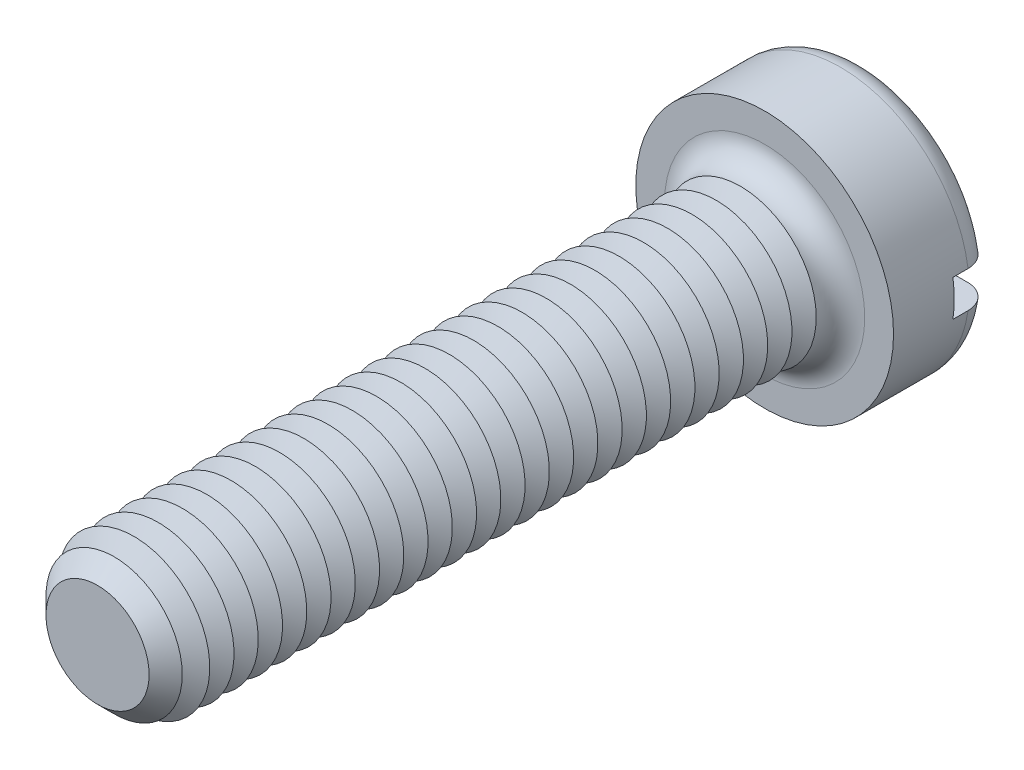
ISO-10303-21;
HEADER;
FILE_DESCRIPTION(('STEP AP214'),'2;1');
FILE_NAME('part.step','',(''),(''),'','','');
FILE_SCHEMA(('AUTOMOTIVE_DESIGN { 1 0 10303 214 1 1 1 1 }'));
ENDSEC;
DATA;
#1=APPLICATION_CONTEXT('core data for automotive mechanical design processes');
#2=APPLICATION_PROTOCOL_DEFINITION('international standard','automotive_design',2000,#1);
#3=PRODUCT_CONTEXT('',#1,'mechanical');
#4=PRODUCT('Part','Part','',(#3));
#5=PRODUCT_RELATED_PRODUCT_CATEGORY('part','',(#4));
#6=PRODUCT_DEFINITION_FORMATION('','',#4);
#7=PRODUCT_DEFINITION_CONTEXT('part definition',#1,'design');
#8=PRODUCT_DEFINITION('design','',#6,#7);
#9=PRODUCT_DEFINITION_SHAPE('','',#8);
#10=(LENGTH_UNIT() NAMED_UNIT(*) SI_UNIT(.MILLI.,.METRE.));
#11=(NAMED_UNIT(*) PLANE_ANGLE_UNIT() SI_UNIT($,.RADIAN.));
#12=(NAMED_UNIT(*) SI_UNIT($,.STERADIAN.) SOLID_ANGLE_UNIT());
#13=UNCERTAINTY_MEASURE_WITH_UNIT(LENGTH_MEASURE(1.E-05),#10,'distance_accuracy_value','');
#14=(GEOMETRIC_REPRESENTATION_CONTEXT(3) GLOBAL_UNCERTAINTY_ASSIGNED_CONTEXT((#13)) GLOBAL_UNIT_ASSIGNED_CONTEXT((#10,
#11,#12)) REPRESENTATION_CONTEXT('',''));
#15=CARTESIAN_POINT('',(0.,0.,0.));
#16=DIRECTION('',(0.,0.,1.));
#17=DIRECTION('',(1.,0.,0.));
#18=AXIS2_PLACEMENT_3D('',#15,#16,#17);
#19=CARTESIAN_POINT('',(0.,0.,-3.3));
#20=DIRECTION('',(0.,0.,1.));
#21=DIRECTION('',(1.,0.,0.));
#22=AXIS2_PLACEMENT_3D('',#19,#20,#21);
#23=PLANE('',#22);
#24=CARTESIAN_POINT('',(0.,0.,-3.3));
#25=DIRECTION('',(0.,0.,1.));
#26=DIRECTION('',(1.,0.,0.));
#27=AXIS2_PLACEMENT_3D('',#24,#25,#26);
#28=CIRCLE('',#27,3.45);
#29=CARTESIAN_POINT('',(-3.39742549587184,0.6,-3.3));
#30=VERTEX_POINT('',#29);
#31=CARTESIAN_POINT('',(3.39742549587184,0.6,-3.3));
#32=VERTEX_POINT('',#31);
#33=EDGE_CURVE('E116',#30,#32,#28,.F.);
#34=ORIENTED_EDGE('',*,*,#33,.T.);
#35=DIRECTION('',(1.,0.,0.));
#36=VECTOR('',#35,1.);
#37=CARTESIAN_POINT('',(-4.25,0.600000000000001,-3.3));
#38=LINE('',#37,#36);
#39=EDGE_CURVE('E111',#30,#32,#38,.T.);
#40=ORIENTED_EDGE('',*,*,#39,.F.);
#41=EDGE_LOOP('',(#34,#40));
#42=FACE_BOUND('',#41,.T.);
#43=ADVANCED_FACE('F39',(#42),#23,.F.);
#44=CARTESIAN_POINT('',(0.,0.,-2.5));
#45=DIRECTION('',(0.,0.,1.));
#46=DIRECTION('',(1.,0.,0.));
#47=AXIS2_PLACEMENT_3D('',#44,#45,#46);
#48=TOROIDAL_SURFACE('',#47,3.45,0.8);
#49=CARTESIAN_POINT('',(-4.06369072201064,0.600000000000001,-2.95537828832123));
#50=CARTESIAN_POINT('',(-4.03774340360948,0.600000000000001,-2.99245078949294));
#51=CARTESIAN_POINT('',(-4.00861849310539,0.600000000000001,-3.02734231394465));
#52=CARTESIAN_POINT('',(-3.94488199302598,0.600000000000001,-3.0917502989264));
#53=CARTESIAN_POINT('',(-3.91026320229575,0.600000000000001,-3.12125959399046));
#54=CARTESIAN_POINT('',(-3.83660561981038,0.600000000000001,-3.17403695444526));
#55=CARTESIAN_POINT('',(-3.79757117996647,0.6,-3.19731109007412));
#56=CARTESIAN_POINT('',(-3.71618817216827,0.6,-3.23703443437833));
#57=CARTESIAN_POINT('',(-3.67384041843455,0.6,-3.25348531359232));
#58=CARTESIAN_POINT('',(-3.58661930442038,0.6,-3.2792758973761));
#59=CARTESIAN_POINT('',(-3.54172669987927,0.6,-3.288550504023));
#60=CARTESIAN_POINT('',(-3.45102322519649,0.6,-3.29952632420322));
#61=CARTESIAN_POINT('',(-3.40521225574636,0.6,-3.30122671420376));
#62=CARTESIAN_POINT('',(-3.31340831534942,0.6,-3.29701196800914));
#63=CARTESIAN_POINT('',(-3.26741940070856,0.6,-3.29100823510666));
#64=CARTESIAN_POINT('',(-3.17708556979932,0.6,-3.27141469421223));
#65=CARTESIAN_POINT('',(-3.13274074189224,0.6,-3.25782447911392));
#66=CARTESIAN_POINT('',(-3.0466814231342,0.6,-3.22332549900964));
#67=CARTESIAN_POINT('',(-3.00498444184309,0.6,-3.20237301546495));
#68=CARTESIAN_POINT('',(-2.92572251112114,0.6,-3.15372961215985));
#69=CARTESIAN_POINT('',(-2.88815755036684,0.6,-3.12603871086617));
#70=CARTESIAN_POINT('',(-2.81847654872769,0.6,-3.06483322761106));
#71=CARTESIAN_POINT('',(-2.78633186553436,0.6,-3.03135128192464));
#72=CARTESIAN_POINT('',(-2.72824805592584,0.6,-2.95937651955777));
#73=CARTESIAN_POINT('',(-2.70230829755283,0.6,-2.92088421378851));
#74=CARTESIAN_POINT('',(-2.65791262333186,0.6,-2.84074227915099));
#75=CARTESIAN_POINT('',(-2.63932560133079,0.6,-2.79916531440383));
#76=CARTESIAN_POINT('',(-2.60958432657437,0.6,-2.7134333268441));
#77=CARTESIAN_POINT('',(-2.59842889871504,0.6,-2.66927871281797));
#78=CARTESIAN_POINT('',(-2.58411140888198,0.6,-2.58073966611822));
#79=CARTESIAN_POINT('',(-2.58077086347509,0.6,-2.5363840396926));
#80=CARTESIAN_POINT('',(-2.58167367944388,0.6,-2.44775208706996));
#81=CARTESIAN_POINT('',(-2.58591644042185,0.6,-2.40347575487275));
#82=CARTESIAN_POINT('',(-2.60175154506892,0.6,-2.31675105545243));
#83=CARTESIAN_POINT('',(-2.61326489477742,0.6,-2.27428821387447));
#84=CARTESIAN_POINT('',(-2.6431863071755,0.6,-2.19186794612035));
#85=CARTESIAN_POINT('',(-2.66159465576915,0.6,-2.15191062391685));
#86=CARTESIAN_POINT('',(-2.70494650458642,0.6,-2.07517696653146));
#87=CARTESIAN_POINT('',(-2.72995486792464,0.6,-2.03843731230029));
#88=CARTESIAN_POINT('',(-2.7856570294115,0.6,-1.96955746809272));
#89=CARTESIAN_POINT('',(-2.81635145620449,0.6,-1.93741778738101));
#90=CARTESIAN_POINT('',(-2.88329572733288,0.6,-1.87788048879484));
#91=CARTESIAN_POINT('',(-2.91965530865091,0.6,-1.85060625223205));
#92=CARTESIAN_POINT('',(-2.9963658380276,0.6,-1.80241044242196));
#93=CARTESIAN_POINT('',(-3.03671721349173,0.6,-1.78148955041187));
#94=CARTESIAN_POINT('',(-3.12111125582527,0.6,-1.74619829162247));
#95=CARTESIAN_POINT('',(-3.16521020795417,0.6,-1.73196239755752));
#96=CARTESIAN_POINT('',(-3.25516487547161,0.6,-1.71103773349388));
#97=CARTESIAN_POINT('',(-3.30102068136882,0.6,-1.70434935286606));
#98=CARTESIAN_POINT('',(-3.39352689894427,0.6,-1.69870104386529));
#99=CARTESIAN_POINT('',(-3.44018061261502,0.6,-1.69979487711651));
#100=CARTESIAN_POINT('',(-3.53263583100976,0.6,-1.70983959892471));
#101=CARTESIAN_POINT('',(-3.57843734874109,0.6,-1.71879036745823));
#102=CARTESIAN_POINT('',(-3.66763544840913,0.6,-1.74426972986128));
#103=CARTESIAN_POINT('',(-3.71104292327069,0.6,-1.76076015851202));
#104=CARTESIAN_POINT('',(-3.79442616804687,0.6,-1.80087686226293));
#105=CARTESIAN_POINT('',(-3.83440212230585,0.600000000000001,-1.82450275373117));
#106=CARTESIAN_POINT('',(-3.90929765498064,0.600000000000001,-1.87793548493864));
#107=CARTESIAN_POINT('',(-3.94426963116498,0.600000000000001,-1.90766887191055));
#108=CARTESIAN_POINT('',(-4.00864839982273,0.600000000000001,-1.9726503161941));
#109=CARTESIAN_POINT('',(-4.03805555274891,0.600000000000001,-2.00789801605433));
#110=CARTESIAN_POINT('',(-4.09009460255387,0.600000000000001,-2.08244463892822));
#111=CARTESIAN_POINT('',(-4.11280448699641,0.600000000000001,-2.12168912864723));
#112=CARTESIAN_POINT('',(-4.15124086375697,0.600000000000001,-2.2034588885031));
#113=CARTESIAN_POINT('',(-4.16696802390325,0.600000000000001,-2.24598384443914));
#114=CARTESIAN_POINT('',(-4.19085131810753,0.600000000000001,-2.33267862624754));
#115=CARTESIAN_POINT('',(-4.19907708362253,0.600000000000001,-2.37682928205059));
#116=CARTESIAN_POINT('',(-4.2079638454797,0.600000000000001,-2.46589754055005));
#117=CARTESIAN_POINT('',(-4.20862315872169,0.600000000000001,-2.51081531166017));
#118=CARTESIAN_POINT('',(-4.20236829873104,0.600000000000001,-2.59993343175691));
#119=CARTESIAN_POINT('',(-4.19548454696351,0.600000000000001,-2.64413593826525));
#120=CARTESIAN_POINT('',(-4.17439924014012,0.600000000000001,-2.73071930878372));
#121=CARTESIAN_POINT('',(-4.16020675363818,0.600000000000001,-2.77310235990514));
#122=CARTESIAN_POINT('',(-4.1318825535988,0.600000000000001,-2.83880495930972));
#123=CARTESIAN_POINT('',(-4.11991183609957,0.600000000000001,-2.86307959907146));
#124=CARTESIAN_POINT('',(-4.09356927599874,0.600000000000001,-2.91028856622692));
#125=CARTESIAN_POINT('',(-4.07919744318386,0.600000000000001,-2.9332228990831));
#126=CARTESIAN_POINT('',(-4.06369072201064,0.600000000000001,-2.95537828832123));
#127=B_SPLINE_CURVE_WITH_KNOTS('',3,(#49,#50,#51,#52,#53,#54,#55,#56,#57,#58,#59,#60,#61,#62,
#63,#64,#65,#66,#67,#68,#69,#70,#71,#72,#73,#74,#75,#76,#77,#78,#79,#80,#81,#82,#83,#84,#85,#86,
#87,#88,#89,#90,#91,#92,#93,#94,#95,#96,#97,#98,#99,#100,#101,#102,#103,#104,#105,#106,#107,
#108,#109,#110,#111,#112,#113,#114,#115,#116,#117,#118,#119,#120,#121,#122,#123,#124,#125,#126),
.UNSPECIFIED.,.T.,.F.,(4,2,2,2,2,2,2,2,2,2,2,2,2,2,2,2,2,2,2,2,2,2,2,2,2,2,2,2,2,2,2,2,2,2,2,2,
2,2,4),(0.,0.13565225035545,0.271483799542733,0.407182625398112,0.542848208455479,
0.679730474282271,0.816627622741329,0.955113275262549,1.09360635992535,1.23293614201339,
1.37226554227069,1.51083389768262,1.64938813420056,1.78534653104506,1.92128342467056,
2.0540840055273,2.18687407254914,2.31824564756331,2.44962267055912,2.58234229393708,
2.71507659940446,2.85080630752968,2.98655056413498,3.12491938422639,3.26329534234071,
3.40262816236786,3.54195885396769,3.68059194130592,3.81921757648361,3.95626453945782,
4.09330262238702,4.2286754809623,4.36403538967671,4.49812564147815,4.63224572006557,
4.76582687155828,4.89924267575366,4.98031194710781,5.0613808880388),.UNSPECIFIED.);
#128=CARTESIAN_POINT('',(-4.20743389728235,0.600000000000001,-2.50000000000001));
#129=VERTEX_POINT('',#128);
#130=EDGE_CURVE('E393',#129,#30,#127,.T.);
#131=ORIENTED_EDGE('',*,*,#130,.F.);
#132=CARTESIAN_POINT('',(0.,0.,-2.5));
#133=DIRECTION('',(0.,0.,1.));
#134=DIRECTION('',(1.,0.,0.));
#135=AXIS2_PLACEMENT_3D('',#132,#133,#134);
#136=CIRCLE('',#135,4.25);
#137=CARTESIAN_POINT('',(4.20743389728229,0.599999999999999,-2.5));
#138=VERTEX_POINT('',#137);
#139=EDGE_CURVE('E125',#138,#129,#136,.T.);
#140=ORIENTED_EDGE('',*,*,#139,.F.);
#141=CARTESIAN_POINT('',(2.63947327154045,0.6,-2.79608831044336));
#142=CARTESIAN_POINT('',(2.65655980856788,0.6,-2.83790320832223));
#143=CARTESIAN_POINT('',(2.67725642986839,0.6,-2.87828303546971));
#144=CARTESIAN_POINT('',(2.72519250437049,0.6,-2.95500233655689));
#145=CARTESIAN_POINT('',(2.75244152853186,0.6,-2.9913357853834));
#146=CARTESIAN_POINT('',(2.81257938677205,0.6,-3.05889430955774));
#147=CARTESIAN_POINT('',(2.84545995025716,0.6,-3.09012674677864));
#148=CARTESIAN_POINT('',(2.91591143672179,0.6,-3.14672620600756));
#149=CARTESIAN_POINT('',(2.95348119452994,0.6,-3.17209468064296));
#150=CARTESIAN_POINT('',(3.03291143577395,0.6,-3.21669611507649));
#151=CARTESIAN_POINT('',(3.07483186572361,0.6,-3.23582234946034));
#152=CARTESIAN_POINT('',(3.16126659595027,0.6,-3.26686062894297));
#153=CARTESIAN_POINT('',(3.2057811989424,0.6,-3.27877183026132));
#154=CARTESIAN_POINT('',(3.29669878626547,0.6,-3.29514603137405));
#155=CARTESIAN_POINT('',(3.34311773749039,0.6,-3.29952056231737));
#156=CARTESIAN_POINT('',(3.43603189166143,0.6,-3.30040472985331));
#157=CARTESIAN_POINT('',(3.48252709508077,0.6,-3.29691431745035));
#158=CARTESIAN_POINT('',(3.57420049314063,0.6,-3.28214240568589));
#159=CARTESIAN_POINT('',(3.61938038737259,0.6,-3.27087147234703));
#160=CARTESIAN_POINT('',(3.70717477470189,0.6,-3.24082890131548));
#161=CARTESIAN_POINT('',(3.74978938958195,0.6,-3.22205762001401));
#162=CARTESIAN_POINT('',(3.83078828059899,0.6,-3.17773607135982));
#163=CARTESIAN_POINT('',(3.86921015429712,0.599999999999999,-3.15225453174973));
#164=CARTESIAN_POINT('',(3.94116038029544,0.599999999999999,-3.09512672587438));
#165=CARTESIAN_POINT('',(3.9746890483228,0.599999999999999,-3.06348085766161));
#166=CARTESIAN_POINT('',(4.03545911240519,0.599999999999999,-2.99534640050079));
#167=CARTESIAN_POINT('',(4.06277344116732,0.599999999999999,-2.95892285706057));
#168=CARTESIAN_POINT('',(4.11082191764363,0.599999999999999,-2.88196698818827));
#169=CARTESIAN_POINT('',(4.13155647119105,0.599999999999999,-2.84143491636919));
#170=CARTESIAN_POINT('',(4.16563480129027,0.599999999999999,-2.75787550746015));
#171=CARTESIAN_POINT('',(4.1790544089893,0.599999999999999,-2.71487908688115));
#172=CARTESIAN_POINT('',(4.19843340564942,0.599999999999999,-2.62723691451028));
#173=CARTESIAN_POINT('',(4.20439310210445,0.599999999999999,-2.58259123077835));
#174=CARTESIAN_POINT('',(4.2086595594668,0.599999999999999,-2.49321831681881));
#175=CARTESIAN_POINT('',(4.20701422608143,0.599999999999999,-2.4484933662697));
#176=CARTESIAN_POINT('',(4.1962295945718,0.599999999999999,-2.35995704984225));
#177=CARTESIAN_POINT('',(4.18709040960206,0.599999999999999,-2.31614567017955));
#178=CARTESIAN_POINT('',(4.16160290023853,0.599999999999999,-2.23072100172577));
#179=CARTESIAN_POINT('',(4.14526169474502,0.599999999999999,-2.18910558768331));
#180=CARTESIAN_POINT('',(4.10585410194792,0.599999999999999,-2.10919238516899));
#181=CARTESIAN_POINT('',(4.08278762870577,0.599999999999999,-2.07089463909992));
#182=CARTESIAN_POINT('',(4.030487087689,0.599999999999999,-1.99851484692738));
#183=CARTESIAN_POINT('',(4.00122628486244,0.599999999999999,-1.9644521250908));
#184=CARTESIAN_POINT('',(3.93744772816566,0.599999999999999,-1.90166877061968));
#185=CARTESIAN_POINT('',(3.90292977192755,0.599999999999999,-1.87294834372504));
#186=CARTESIAN_POINT('',(3.82928727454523,0.599999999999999,-1.82137853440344));
#187=CARTESIAN_POINT('',(3.79012374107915,0.6,-1.79858484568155));
#188=CARTESIAN_POINT('',(3.70856025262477,0.6,-1.75980712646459));
#189=CARTESIAN_POINT('',(3.66616010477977,0.6,-1.74382350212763));
#190=CARTESIAN_POINT('',(3.57878495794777,0.6,-1.71891499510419));
#191=CARTESIAN_POINT('',(3.53378519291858,0.6,-1.71007699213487));
#192=CARTESIAN_POINT('',(3.44294322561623,0.6,-1.69998722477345));
#193=CARTESIAN_POINT('',(3.3971009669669,0.6,-1.69873596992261));
#194=CARTESIAN_POINT('',(3.30531297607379,0.6,-1.70385439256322));
#195=CARTESIAN_POINT('',(3.25937213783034,0.6,-1.71031204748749));
#196=CARTESIAN_POINT('',(3.1692099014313,0.6,-1.73080107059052));
#197=CARTESIAN_POINT('',(3.12498860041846,0.6,-1.74483286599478));
#198=CARTESIAN_POINT('',(3.03926209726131,0.6,-1.78018941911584));
#199=CARTESIAN_POINT('',(2.99777407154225,0.6,-1.80155586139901));
#200=CARTESIAN_POINT('',(2.91899881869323,0.6,-1.85098881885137));
#201=CARTESIAN_POINT('',(2.88171158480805,0.6,-1.8790553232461));
#202=CARTESIAN_POINT('',(2.81266124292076,0.6,-1.94094884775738));
#203=CARTESIAN_POINT('',(2.78086710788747,0.6,-1.97474122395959));
#204=CARTESIAN_POINT('',(2.72353615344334,0.6,-2.0472724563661));
#205=CARTESIAN_POINT('',(2.69799841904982,0.6,-2.08601058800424));
#206=CARTESIAN_POINT('',(2.65444718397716,0.6,-2.16655019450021));
#207=CARTESIAN_POINT('',(2.63629889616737,0.6,-2.20827875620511));
#208=CARTESIAN_POINT('',(2.60744942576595,0.6,-2.29424821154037));
#209=CARTESIAN_POINT('',(2.59674901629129,0.6,-2.33848936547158));
#210=CARTESIAN_POINT('',(2.5833312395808,0.6,-2.42714258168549));
#211=CARTESIAN_POINT('',(2.58043995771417,0.6,-2.47152848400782));
#212=CARTESIAN_POINT('',(2.58224493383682,0.6,-2.56010574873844));
#213=CARTESIAN_POINT('',(2.58693104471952,0.6,-2.60429729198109));
#214=CARTESIAN_POINT('',(2.60020046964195,0.6,-2.67311978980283));
#215=CARTESIAN_POINT('',(2.60635343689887,0.6,-2.69824441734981));
#216=CARTESIAN_POINT('',(2.62110140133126,0.6,-2.74776540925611));
#217=CARTESIAN_POINT('',(2.62969634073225,0.6,-2.77216179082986));
#218=CARTESIAN_POINT('',(2.63947327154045,0.6,-2.79608831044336));
#219=B_SPLINE_CURVE_WITH_KNOTS('',3,(#141,#142,#143,#144,#145,#146,#147,#148,#149,#150,#151,
#152,#153,#154,#155,#156,#157,#158,#159,#160,#161,#162,#163,#164,#165,#166,#167,#168,#169,#170,
#171,#172,#173,#174,#175,#176,#177,#178,#179,#180,#181,#182,#183,#184,#185,#186,#187,#188,#189,
#190,#191,#192,#193,#194,#195,#196,#197,#198,#199,#200,#201,#202,#203,#204,#205,#206,#207,#208,
#209,#210,#211,#212,#213,#214,#215,#216,#217,#218),.UNSPECIFIED.,.T.,.F.,(4,2,2,2,2,2,2,2,2,2,2,
2,2,2,2,2,2,2,2,2,2,2,2,2,2,2,2,2,2,2,2,2,2,2,2,2,2,2,4),(0.,0.135416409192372,
0.271031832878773,0.406449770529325,0.541834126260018,0.679424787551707,0.817031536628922,
0.956242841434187,1.09545501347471,1.23447850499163,1.37349539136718,1.51114036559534,
1.64877645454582,1.78470267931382,1.92062051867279,2.05510117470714,2.1895762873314,
2.32320547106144,2.45683263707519,2.59032801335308,2.72382509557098,2.85791055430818,
2.99200117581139,3.12730969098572,3.26262627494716,3.39956435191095,3.53651162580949,
3.67503685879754,3.81356990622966,3.95290367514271,4.09223721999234,4.23075602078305,
4.36925455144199,4.50509949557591,4.6409585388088,4.77376594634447,4.90639565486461,
4.98388287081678,5.06136825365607),.UNSPECIFIED.);
#220=EDGE_CURVE('E395',#32,#138,#219,.T.);
#221=ORIENTED_EDGE('',*,*,#220,.F.);
#222=ORIENTED_EDGE('',*,*,#33,.F.);
#223=EDGE_LOOP('',(#131,#140,#221,#222));
#224=FACE_BOUND('',#223,.T.);
#225=ADVANCED_FACE('F377',(#224),#48,.T.);
#226=CARTESIAN_POINT('',(0.,0.,-3.3));
#227=DIRECTION('',(0.,0.,1.));
#228=DIRECTION('',(1.,0.,0.));
#229=AXIS2_PLACEMENT_3D('',#226,#227,#228);
#230=CYLINDRICAL_SURFACE('',#229,4.25);
#231=DIRECTION('',(0.,0.,1.));
#232=VECTOR('',#231,1.);
#233=CARTESIAN_POINT('',(4.20743389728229,0.599999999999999,-3.3));
#234=LINE('',#233,#232);
#235=CARTESIAN_POINT('',(4.20743389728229,0.599999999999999,-2.));
#236=VERTEX_POINT('',#235);
#237=EDGE_CURVE('E411',#138,#236,#234,.T.);
#238=ORIENTED_EDGE('',*,*,#237,.F.);
#239=ORIENTED_EDGE('',*,*,#139,.T.);
#240=DIRECTION('',(0.,0.,1.));
#241=VECTOR('',#240,1.);
#242=CARTESIAN_POINT('',(-4.20743389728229,0.600000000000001,-3.3));
#243=LINE('',#242,#241);
#244=CARTESIAN_POINT('',(-4.20743389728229,0.600000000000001,-2.));
#245=VERTEX_POINT('',#244);
#246=EDGE_CURVE('E63',#245,#129,#243,.F.);
#247=ORIENTED_EDGE('',*,*,#246,.F.);
#248=CARTESIAN_POINT('',(0.,0.,-2.));
#249=DIRECTION('',(0.,0.,-1.));
#250=DIRECTION('',(-1.,0.,0.));
#251=AXIS2_PLACEMENT_3D('',#248,#249,#250);
#252=CIRCLE('',#251,4.25);
#253=CARTESIAN_POINT('',(-4.20743389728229,-0.599999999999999,-2.));
#254=VERTEX_POINT('',#253);
#255=EDGE_CURVE('E43',#245,#254,#252,.F.);
#256=ORIENTED_EDGE('',*,*,#255,.T.);
#257=DIRECTION('',(0.,0.,1.));
#258=VECTOR('',#257,1.);
#259=CARTESIAN_POINT('',(-4.20743389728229,-0.599999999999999,-3.3));
#260=LINE('',#259,#258);
#261=CARTESIAN_POINT('',(-4.20743389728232,-0.599999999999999,-2.5));
#262=VERTEX_POINT('',#261);
#263=EDGE_CURVE('E408',#262,#254,#260,.T.);
#264=ORIENTED_EDGE('',*,*,#263,.F.);
#265=CARTESIAN_POINT('',(4.20743389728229,-0.600000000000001,-2.5));
#266=VERTEX_POINT('',#265);
#267=EDGE_CURVE('E127',#262,#266,#136,.T.);
#268=ORIENTED_EDGE('',*,*,#267,.T.);
#269=DIRECTION('',(0.,0.,1.));
#270=VECTOR('',#269,1.);
#271=CARTESIAN_POINT('',(4.20743389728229,-0.600000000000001,-3.3));
#272=LINE('',#271,#270);
#273=CARTESIAN_POINT('',(4.20743389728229,-0.600000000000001,-2.));
#274=VERTEX_POINT('',#273);
#275=EDGE_CURVE('E55',#274,#266,#272,.F.);
#276=ORIENTED_EDGE('',*,*,#275,.F.);
#277=EDGE_CURVE('E11',#274,#236,#252,.F.);
#278=ORIENTED_EDGE('',*,*,#277,.T.);
#279=EDGE_LOOP('',(#238,#239,#247,#256,#264,#268,#276,#278));
#280=FACE_BOUND('',#279,.T.);
#281=CARTESIAN_POINT('',(0.,0.,0.));
#282=DIRECTION('',(0.,0.,1.));
#283=DIRECTION('',(1.,0.,0.));
#284=AXIS2_PLACEMENT_3D('',#281,#282,#283);
#285=CIRCLE('',#284,4.25);
#286=CARTESIAN_POINT('',(4.25,0.,0.));
#287=VERTEX_POINT('',#286);
#288=EDGE_CURVE('E414',#287,#287,#285,.T.);
#289=ORIENTED_EDGE('',*,*,#288,.F.);
#290=EDGE_LOOP('',(#289));
#291=FACE_BOUND('',#290,.T.);
#292=ADVANCED_FACE('F373',(#280,#291),#230,.T.);
#293=CARTESIAN_POINT('',(3.39742549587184,-0.6,-3.3));
#294=VERTEX_POINT('',#293);
#295=CARTESIAN_POINT('',(-3.39742549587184,-0.6,-3.3));
#296=VERTEX_POINT('',#295);
#297=EDGE_CURVE('E109',#294,#296,#28,.F.);
#298=ORIENTED_EDGE('',*,*,#297,.T.);
#299=DIRECTION('',(-1.,0.,0.));
#300=VECTOR('',#299,1.);
#301=CARTESIAN_POINT('',(-4.25,-0.599999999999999,-3.3));
#302=LINE('',#301,#300);
#303=EDGE_CURVE('E96',#294,#296,#302,.T.);
#304=ORIENTED_EDGE('',*,*,#303,.F.);
#305=EDGE_LOOP('',(#298,#304));
#306=FACE_BOUND('',#305,.T.);
#307=ADVANCED_FACE('F108',(#306),#23,.F.);
#308=CARTESIAN_POINT('',(0.,0.,0.));
#309=DIRECTION('',(0.,0.,1.));
#310=DIRECTION('',(1.,0.,0.));
#311=AXIS2_PLACEMENT_3D('',#308,#309,#310);
#312=PLANE('',#311);
#313=CARTESIAN_POINT('',(0.,0.,0.));
#314=DIRECTION('',(0.,0.,1.));
#315=DIRECTION('',(1.,0.,0.));
#316=AXIS2_PLACEMENT_3D('',#313,#314,#315);
#317=CIRCLE('',#316,3.3);
#318=CARTESIAN_POINT('',(3.3,0.,0.));
#319=VERTEX_POINT('',#318);
#320=EDGE_CURVE('E115',#319,#319,#317,.F.);
#321=ORIENTED_EDGE('',*,*,#320,.T.);
#322=EDGE_LOOP('',(#321));
#323=FACE_BOUND('',#322,.T.);
#324=ORIENTED_EDGE('',*,*,#288,.T.);
#325=EDGE_LOOP('',(#324));
#326=FACE_BOUND('',#325,.T.);
#327=ADVANCED_FACE('F372',(#323,#326),#312,.T.);
#328=CARTESIAN_POINT('',(-4.06369072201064,-0.599999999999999,-2.95537828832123));
#329=CARTESIAN_POINT('',(-4.08928577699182,-0.599999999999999,-2.91880204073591));
#330=CARTESIAN_POINT('',(-4.11182555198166,-0.599999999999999,-2.88005030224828));
#331=CARTESIAN_POINT('',(-4.15010404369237,-0.599999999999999,-2.79928452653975));
#332=CARTESIAN_POINT('',(-4.16583526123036,-0.599999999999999,-2.75726695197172));
#333=CARTESIAN_POINT('',(-4.19000286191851,-0.599999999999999,-2.67118996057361));
#334=CARTESIAN_POINT('',(-4.19844101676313,-0.599999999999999,-2.62713104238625));
#335=CARTESIAN_POINT('',(-4.20777174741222,-0.599999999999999,-2.53823222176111));
#336=CARTESIAN_POINT('',(-4.20866608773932,-0.599999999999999,-2.49339250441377));
#337=CARTESIAN_POINT('',(-4.20289683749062,-0.599999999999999,-2.40433856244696));
#338=CARTESIAN_POINT('',(-4.19625607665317,-0.599999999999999,-2.36012285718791));
#339=CARTESIAN_POINT('',(-4.17565084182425,-0.599999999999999,-2.27343166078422));
#340=CARTESIAN_POINT('',(-4.16168615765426,-0.599999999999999,-2.23095621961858));
#341=CARTESIAN_POINT('',(-4.12683188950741,-0.599999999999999,-2.14890863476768));
#342=CARTESIAN_POINT('',(-4.10593663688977,-0.599999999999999,-2.10933890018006));
#343=CARTESIAN_POINT('',(-4.05783763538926,-0.599999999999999,-2.03424145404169));
#344=CARTESIAN_POINT('',(-4.03063375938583,-0.599999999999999,-1.99871382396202));
#345=CARTESIAN_POINT('',(-3.97052236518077,-0.599999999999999,-1.93246905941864));
#346=CARTESIAN_POINT('',(-3.93758114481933,-0.599999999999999,-1.90178251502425));
#347=CARTESIAN_POINT('',(-3.86706007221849,-0.599999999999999,-1.84630837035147));
#348=CARTESIAN_POINT('',(-3.82948001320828,-0.6,-1.82152103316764));
#349=CARTESIAN_POINT('',(-3.75033766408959,-0.6,-1.77826995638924));
#350=CARTESIAN_POINT('',(-3.70873831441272,-0.6,-1.7598740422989));
#351=CARTESIAN_POINT('',(-3.62306661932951,-0.6,-1.73023196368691));
#352=CARTESIAN_POINT('',(-3.57899411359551,-0.6,-1.71898626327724));
#353=CARTESIAN_POINT('',(-3.48904845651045,-0.6,-1.70382025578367));
#354=CARTESIAN_POINT('',(-3.44315982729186,-0.6,-1.69999172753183));
#355=CARTESIAN_POINT('',(-3.35138360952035,-0.6,-1.7000083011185));
#356=CARTESIAN_POINT('',(-3.30549602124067,-0.6,-1.70385391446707));
#357=CARTESIAN_POINT('',(-3.21452492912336,-0.6,-1.71917227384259));
#358=CARTESIAN_POINT('',(-3.16945455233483,-0.6,-1.73072307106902));
#359=CARTESIAN_POINT('',(-3.08188104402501,-0.6,-1.76120640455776));
#360=CARTESIAN_POINT('',(-3.0393780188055,-0.6,-1.78013924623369));
#361=CARTESIAN_POINT('',(-2.95805296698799,-0.6,-1.82493384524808));
#362=CARTESIAN_POINT('',(-2.9192403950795,-0.6,-1.85081278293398));
#363=CARTESIAN_POINT('',(-2.84656695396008,-0.6,-1.90878317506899));
#364=CARTESIAN_POINT('',(-2.81270591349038,-0.6,-1.94087441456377));
#365=CARTESIAN_POINT('',(-2.75131050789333,-0.6,-2.01002500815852));
#366=CARTESIAN_POINT('',(-2.72371339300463,-0.6,-2.04702860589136));
#367=CARTESIAN_POINT('',(-2.67528742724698,-0.6,-2.12522869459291));
#368=CARTESIAN_POINT('',(-2.65445765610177,-0.6,-2.1664246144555));
#369=CARTESIAN_POINT('',(-2.62065354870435,-0.6,-2.25087266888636));
#370=CARTESIAN_POINT('',(-2.60751663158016,-0.6,-2.29405971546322));
#371=CARTESIAN_POINT('',(-2.58885106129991,-0.6,-2.38204659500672));
#372=CARTESIAN_POINT('',(-2.58332131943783,-0.6,-2.42684619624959));
#373=CARTESIAN_POINT('',(-2.58009777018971,-0.6,-2.51580379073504));
#374=CARTESIAN_POINT('',(-2.58224575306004,-0.6,-2.55995612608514));
#375=CARTESIAN_POINT('',(-2.59395205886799,-0.6,-2.64726495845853));
#376=CARTESIAN_POINT('',(-2.60351013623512,-0.6,-2.69042148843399));
#377=CARTESIAN_POINT('',(-2.62967159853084,-0.6,-2.77438771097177));
#378=CARTESIAN_POINT('',(-2.64625243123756,-0.6,-2.81520444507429));
#379=CARTESIAN_POINT('',(-2.68592348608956,-0.6,-2.89353901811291));
#380=CARTESIAN_POINT('',(-2.70901418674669,-0.6,-2.9310566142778));
#381=CARTESIAN_POINT('',(-2.7614318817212,-0.6,-3.00240040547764));
#382=CARTESIAN_POINT('',(-2.79085487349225,-0.6,-3.03615603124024));
#383=CARTESIAN_POINT('',(-2.85483456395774,-0.6,-3.09838834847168));
#384=CARTESIAN_POINT('',(-2.88939187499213,-0.6,-3.12686440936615));
#385=CARTESIAN_POINT('',(-2.96351967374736,-0.6,-3.17841283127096));
#386=CARTESIAN_POINT('',(-3.00318741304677,-0.6,-3.20134539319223));
#387=CARTESIAN_POINT('',(-3.08576649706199,-0.6,-3.24034364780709));
#388=CARTESIAN_POINT('',(-3.12867814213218,-0.6,-3.25640870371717));
#389=CARTESIAN_POINT('',(-3.21724048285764,-0.6,-3.28143816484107));
#390=CARTESIAN_POINT('',(-3.26292314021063,-0.6,-3.29028963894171));
#391=CARTESIAN_POINT('',(-3.35512527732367,-0.6,-3.30021681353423));
#392=CARTESIAN_POINT('',(-3.40164474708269,-0.6,-3.30129260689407));
#393=CARTESIAN_POINT('',(-3.49429978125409,-0.6,-3.29560589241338));
#394=CARTESIAN_POINT('',(-3.54043436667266,-0.6,-3.28882735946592));
#395=CARTESIAN_POINT('',(-3.63090382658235,-0.6,-3.26755492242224));
#396=CARTESIAN_POINT('',(-3.67523831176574,-0.6,-3.25305935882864));
#397=CARTESIAN_POINT('',(-3.76046509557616,-0.6,-3.21686867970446));
#398=CARTESIAN_POINT('',(-3.80138087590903,-0.599999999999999,-3.1952288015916));
#399=CARTESIAN_POINT('',(-3.8788986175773,-0.599999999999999,-3.14531817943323));
#400=CARTESIAN_POINT('',(-3.91550599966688,-0.599999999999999,-3.11705590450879));
#401=CARTESIAN_POINT('',(-3.97074313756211,-0.599999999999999,-3.06628809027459));
#402=CARTESIAN_POINT('',(-3.99100743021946,-0.599999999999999,-3.04553102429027));
#403=CARTESIAN_POINT('',(-4.02917385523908,-0.599999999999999,-3.00194762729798));
#404=CARTESIAN_POINT('',(-4.04707600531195,-0.599999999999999,-2.97912131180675));
#405=CARTESIAN_POINT('',(-4.06369072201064,-0.599999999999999,-2.95537828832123));
#406=B_SPLINE_CURVE_WITH_KNOTS('',3,(#328,#329,#330,#331,#332,#333,#334,#335,#336,#337,#338,
#339,#340,#341,#342,#343,#344,#345,#346,#347,#348,#349,#350,#351,#352,#353,#354,#355,#356,#357,
#358,#359,#360,#361,#362,#363,#364,#365,#366,#367,#368,#369,#370,#371,#372,#373,#374,#375,#376,
#377,#378,#379,#380,#381,#382,#383,#384,#385,#386,#387,#388,#389,#390,#391,#392,#393,#394,#395,
#396,#397,#398,#399,#400,#401,#402,#403,#404,#405),.UNSPECIFIED.,.T.,.F.,(4,2,2,2,2,2,2,2,2,2,2,
2,2,2,2,2,2,2,2,2,2,2,2,2,2,2,2,2,2,2,2,2,2,2,2,2,2,2,4),(0.,0.133821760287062,
0.267790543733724,0.401726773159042,0.535631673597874,0.669131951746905,0.802636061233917,
0.936249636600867,1.06986590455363,1.2042952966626,1.3387306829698,1.47455198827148,
1.61038210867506,1.74788249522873,1.88539204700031,2.02431612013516,2.16324594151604,
2.30252260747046,2.4417944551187,2.57960263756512,2.71739207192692,2.85215325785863,
2.98689515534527,3.11887666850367,3.25085380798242,3.38241030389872,3.51397647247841,
3.64769871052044,3.78143690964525,3.91826005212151,4.05509587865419,4.19403485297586,
4.33297216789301,4.47219345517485,4.61144469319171,4.74964356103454,4.887666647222,
4.97453605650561,5.06140481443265),.UNSPECIFIED.);
#407=EDGE_CURVE('E103',#296,#262,#406,.T.);
#408=ORIENTED_EDGE('',*,*,#407,.F.);
#409=ORIENTED_EDGE('',*,*,#297,.F.);
#410=CARTESIAN_POINT('',(2.63947327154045,-0.6,-2.79608831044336));
#411=CARTESIAN_POINT('',(2.62285766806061,-0.6,-2.75541510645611));
#412=CARTESIAN_POINT('',(2.60963282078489,-0.6,-2.71332585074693));
#413=CARTESIAN_POINT('',(2.59042394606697,-0.6,-2.62749460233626));
#414=CARTESIAN_POINT('',(2.58444686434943,-0.6,-2.58375106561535));
#415=CARTESIAN_POINT('',(2.57995287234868,-0.6,-2.49588524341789));
#416=CARTESIAN_POINT('',(2.58143477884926,-0.6,-2.45176301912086));
#417=CARTESIAN_POINT('',(2.59180622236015,-0.6,-2.36440906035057));
#418=CARTESIAN_POINT('',(2.60069434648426,-0.6,-2.32117715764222));
#419=CARTESIAN_POINT('',(2.62554964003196,-0.6,-2.23689909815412));
#420=CARTESIAN_POINT('',(2.6415022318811,-0.6,-2.19584863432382));
#421=CARTESIAN_POINT('',(2.67996913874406,-0.6,-2.11694797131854));
#422=CARTESIAN_POINT('',(2.70248409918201,-0.6,-2.07909808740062));
#423=CARTESIAN_POINT('',(2.75378972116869,-0.6,-2.00702296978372));
#424=CARTESIAN_POINT('',(2.7826732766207,-0.6,-1.97286389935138));
#425=CARTESIAN_POINT('',(2.84564717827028,-0.6,-1.90974167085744));
#426=CARTESIAN_POINT('',(2.87973812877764,-0.6,-1.88077911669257));
#427=CARTESIAN_POINT('',(2.95300941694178,-0.6,-1.82817307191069));
#428=CARTESIAN_POINT('',(2.99228920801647,-0.6,-1.8046680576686));
#429=CARTESIAN_POINT('',(3.07419050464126,-0.6,-1.76446470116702));
#430=CARTESIAN_POINT('',(3.11681231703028,-0.6,-1.74776698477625));
#431=CARTESIAN_POINT('',(3.20492149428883,-0.6,-1.72140945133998));
#432=CARTESIAN_POINT('',(3.25044365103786,-0.6,-1.71186578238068));
#433=CARTESIAN_POINT('',(3.34244451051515,-0.6,-1.70053183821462));
#434=CARTESIAN_POINT('',(3.38892324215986,-0.6,-1.69874179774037));
#435=CARTESIAN_POINT('',(3.48165030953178,-0.6,-1.70299737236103));
#436=CARTESIAN_POINT('',(3.52789766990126,-0.6,-1.70906439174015));
#437=CARTESIAN_POINT('',(3.61869999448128,-0.6,-1.72893768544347));
#438=CARTESIAN_POINT('',(3.6632550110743,-0.6,-1.742743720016));
#439=CARTESIAN_POINT('',(3.7490339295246,-0.6,-1.77760539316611));
#440=CARTESIAN_POINT('',(3.79028083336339,-0.600000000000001,-1.79860440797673));
#441=CARTESIAN_POINT('',(3.86860401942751,-0.600000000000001,-1.84731105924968));
#442=CARTESIAN_POINT('',(3.90568056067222,-0.600000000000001,-1.87501827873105));
#443=CARTESIAN_POINT('',(3.97412845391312,-0.600000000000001,-1.93599408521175));
#444=CARTESIAN_POINT('',(4.00556369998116,-0.600000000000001,-1.96919094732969));
#445=CARTESIAN_POINT('',(4.06233546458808,-0.600000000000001,-2.0404445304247));
#446=CARTESIAN_POINT('',(4.08767237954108,-0.600000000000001,-2.07850093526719));
#447=CARTESIAN_POINT('',(4.13122502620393,-0.600000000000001,-2.15791791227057));
#448=CARTESIAN_POINT('',(4.14951966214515,-0.600000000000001,-2.19923522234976));
#449=CARTESIAN_POINT('',(4.17884974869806,-0.600000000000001,-2.28437065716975));
#450=CARTESIAN_POINT('',(4.18988555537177,-0.600000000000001,-2.32818865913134));
#451=CARTESIAN_POINT('',(4.20430724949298,-0.600000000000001,-2.41670951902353));
#452=CARTESIAN_POINT('',(4.2077528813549,-0.600000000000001,-2.46140265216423));
#453=CARTESIAN_POINT('',(4.20706844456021,-0.600000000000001,-2.55073028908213));
#454=CARTESIAN_POINT('',(4.20293856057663,-0.600000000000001,-2.595364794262));
#455=CARTESIAN_POINT('',(4.18724926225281,-0.600000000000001,-2.68317733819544));
#456=CARTESIAN_POINT('',(4.17571081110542,-0.600000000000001,-2.72635912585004));
#457=CARTESIAN_POINT('',(4.14556645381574,-0.600000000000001,-2.81017999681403));
#458=CARTESIAN_POINT('',(4.12696052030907,-0.600000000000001,-2.85081907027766));
#459=CARTESIAN_POINT('',(4.08317014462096,-0.600000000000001,-2.92852328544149));
#460=CARTESIAN_POINT('',(4.0579684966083,-0.600000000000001,-2.96557872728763));
#461=CARTESIAN_POINT('',(4.00174565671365,-0.600000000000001,-3.034972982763));
#462=CARTESIAN_POINT('',(3.97072429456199,-0.600000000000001,-3.06731165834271));
#463=CARTESIAN_POINT('',(3.90349659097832,-0.600000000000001,-3.12662735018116));
#464=CARTESIAN_POINT('',(3.86725240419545,-0.600000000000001,-3.15356146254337));
#465=CARTESIAN_POINT('',(3.79079809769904,-0.600000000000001,-3.20104156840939));
#466=CARTESIAN_POINT('',(3.75058775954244,-0.6,-3.22158720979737));
#467=CARTESIAN_POINT('',(3.6668595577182,-0.6,-3.25595832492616));
#468=CARTESIAN_POINT('',(3.62330947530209,-0.6,-3.26970530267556));
#469=CARTESIAN_POINT('',(3.53453348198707,-0.6,-3.28979004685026));
#470=CARTESIAN_POINT('',(3.48930745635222,-0.6,-3.29612730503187));
#471=CARTESIAN_POINT('',(3.39787506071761,-0.6,-3.30128612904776));
#472=CARTESIAN_POINT('',(3.35166346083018,-0.6,-3.30001513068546));
#473=CARTESIAN_POINT('',(3.26009663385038,-0.6,-3.28980210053));
#474=CARTESIAN_POINT('',(3.21474142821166,-0.6,-3.28085987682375));
#475=CARTESIAN_POINT('',(3.12577990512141,-0.6,-3.2554540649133));
#476=CARTESIAN_POINT('',(3.08219120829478,-0.6,-3.23892872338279));
#477=CARTESIAN_POINT('',(2.99839730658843,-0.6,-3.1987810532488));
#478=CARTESIAN_POINT('',(2.95819301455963,-0.6,-3.17515681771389));
#479=CARTESIAN_POINT('',(2.88239372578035,-0.6,-3.12147666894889));
#480=CARTESIAN_POINT('',(2.84679445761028,-0.6,-3.09142678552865));
#481=CARTESIAN_POINT('',(2.78127483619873,-0.6,-3.02571584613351));
#482=CARTESIAN_POINT('',(2.75134725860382,-0.6,-2.99006203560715));
#483=CARTESIAN_POINT('',(2.70767232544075,-0.6,-2.92780516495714));
#484=CARTESIAN_POINT('',(2.69197340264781,-0.6,-2.90254809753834));
#485=CARTESIAN_POINT('',(2.66349078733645,-0.6,-2.8504392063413));
#486=CARTESIAN_POINT('',(2.65070705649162,-0.6,-2.82358740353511));
#487=CARTESIAN_POINT('',(2.63947327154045,-0.6,-2.79608831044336));
#488=B_SPLINE_CURVE_WITH_KNOTS('',3,(#410,#411,#412,#413,#414,#415,#416,#417,#418,#419,#420,
#421,#422,#423,#424,#425,#426,#427,#428,#429,#430,#431,#432,#433,#434,#435,#436,#437,#438,#439,
#440,#441,#442,#443,#444,#445,#446,#447,#448,#449,#450,#451,#452,#453,#454,#455,#456,#457,#458,
#459,#460,#461,#462,#463,#464,#465,#466,#467,#468,#469,#470,#471,#472,#473,#474,#475,#476,#477,
#478,#479,#480,#481,#482,#483,#484,#485,#486,#487),.UNSPECIFIED.,.T.,.F.,(4,2,2,2,2,2,2,2,2,2,2,
2,2,2,2,2,2,2,2,2,2,2,2,2,2,2,2,2,2,2,2,2,2,2,2,2,2,2,4),(0.,0.131701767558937,
0.263529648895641,0.395336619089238,0.527118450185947,0.658629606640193,0.790153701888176,
0.923740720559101,1.05734325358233,1.19403504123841,1.33073939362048,1.46961778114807,
1.60850037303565,1.74776210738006,1.88701952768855,2.02520497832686,2.16338184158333,
2.29987843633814,2.43636615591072,2.57127672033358,2.7061806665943,2.84001889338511,
2.97385385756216,3.1073117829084,3.24077022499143,3.37458034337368,3.50839437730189,
3.64323196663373,3.77807698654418,3.91444452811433,4.05082142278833,4.18886086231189,
4.32690375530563,4.46609131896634,4.60531630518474,4.74441121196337,4.88332773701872,
4.97237227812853,5.06141564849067),.UNSPECIFIED.);
#489=EDGE_CURVE('E92',#266,#294,#488,.T.);
#490=ORIENTED_EDGE('',*,*,#489,.F.);
#491=ORIENTED_EDGE('',*,*,#267,.F.);
#492=EDGE_LOOP('',(#408,#409,#490,#491));
#493=FACE_BOUND('',#492,.T.);
#494=ADVANCED_FACE('F113',(#493),#48,.T.);
#495=CARTESIAN_POINT('',(0.,0.,0.799999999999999));
#496=DIRECTION('',(0.,0.,1.));
#497=DIRECTION('',(1.,0.,0.));
#498=AXIS2_PLACEMENT_3D('',#495,#496,#497);
#499=TOROIDAL_SURFACE('',#498,3.3,0.8);
#500=ORIENTED_EDGE('',*,*,#320,.F.);
#501=EDGE_LOOP('',(#500));
#502=FACE_BOUND('',#501,.T.);
#503=CARTESIAN_POINT('',(0.,0.,0.799999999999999));
#504=DIRECTION('',(0.,0.,-1.));
#505=DIRECTION('',(-1.,0.,0.));
#506=AXIS2_PLACEMENT_3D('',#503,#504,#505);
#507=CIRCLE('',#506,2.5);
#508=CARTESIAN_POINT('',(-2.5,0.,0.799999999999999));
#509=VERTEX_POINT('',#508);
#510=EDGE_CURVE('E420',#509,#509,#507,.T.);
#511=ORIENTED_EDGE('',*,*,#510,.T.);
#512=EDGE_LOOP('',(#511));
#513=FACE_BOUND('',#512,.T.);
#514=ADVANCED_FACE('F365',(#502,#513),#499,.F.);
#515=CARTESIAN_POINT('',(0.,0.,1.2));
#516=DIRECTION('',(0.,0.,-1.));
#517=DIRECTION('',(-1.,0.,0.));
#518=AXIS2_PLACEMENT_3D('',#515,#516,#517);
#519=CONICAL_SURFACE('',#518,1.80717967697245,1.0471975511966);
#520=ORIENTED_EDGE('',*,*,#510,.F.);
#521=EDGE_LOOP('',(#520));
#522=FACE_BOUND('',#521,.T.);
#523=CARTESIAN_POINT('',(0.,0.,1.2));
#524=DIRECTION('',(0.,0.,-1.));
#525=DIRECTION('',(-1.,0.,0.));
#526=AXIS2_PLACEMENT_3D('',#523,#524,#525);
#527=CIRCLE('',#526,1.80717967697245);
#528=CARTESIAN_POINT('',(-1.80717967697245,0.,1.2));
#529=VERTEX_POINT('',#528);
#530=EDGE_CURVE('E426',#529,#529,#527,.T.);
#531=ORIENTED_EDGE('',*,*,#530,.T.);
#532=EDGE_LOOP('',(#531));
#533=FACE_BOUND('',#532,.T.);
#534=ADVANCED_FACE('F361',(#522,#533),#519,.T.);
#535=CARTESIAN_POINT('',(0.,0.,1.6));
#536=DIRECTION('',(0.,0.,1.));
#537=DIRECTION('',(1.,0.,0.));
#538=AXIS2_PLACEMENT_3D('',#535,#536,#537);
#539=CONICAL_SURFACE('',#538,2.5,1.0471975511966);
#540=ORIENTED_EDGE('',*,*,#530,.F.);
#541=EDGE_LOOP('',(#540));
#542=FACE_BOUND('',#541,.T.);
#543=CARTESIAN_POINT('',(0.,0.,1.6));
#544=DIRECTION('',(0.,0.,-1.));
#545=DIRECTION('',(-1.,0.,0.));
#546=AXIS2_PLACEMENT_3D('',#543,#544,#545);
#547=CIRCLE('',#546,2.5);
#548=CARTESIAN_POINT('',(-2.5,0.,1.6));
#549=VERTEX_POINT('',#548);
#550=EDGE_CURVE('E432',#549,#549,#547,.T.);
#551=ORIENTED_EDGE('',*,*,#550,.T.);
#552=EDGE_LOOP('',(#551));
#553=FACE_BOUND('',#552,.T.);
#554=ADVANCED_FACE('F357',(#542,#553),#539,.T.);
#555=CARTESIAN_POINT('',(0.,0.,2.));
#556=DIRECTION('',(0.,0.,-1.));
#557=DIRECTION('',(-1.,0.,0.));
#558=AXIS2_PLACEMENT_3D('',#555,#556,#557);
#559=CONICAL_SURFACE('',#558,1.80717967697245,1.0471975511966);
#560=ORIENTED_EDGE('',*,*,#550,.F.);
#561=EDGE_LOOP('',(#560));
#562=FACE_BOUND('',#561,.T.);
#563=CARTESIAN_POINT('',(0.,0.,2.));
#564=DIRECTION('',(0.,0.,-1.));
#565=DIRECTION('',(-1.,0.,0.));
#566=AXIS2_PLACEMENT_3D('',#563,#564,#565);
#567=CIRCLE('',#566,1.80717967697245);
#568=CARTESIAN_POINT('',(-1.80717967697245,0.,2.));
#569=VERTEX_POINT('',#568);
#570=EDGE_CURVE('E436',#569,#569,#567,.T.);
#571=ORIENTED_EDGE('',*,*,#570,.T.);
#572=EDGE_LOOP('',(#571));
#573=FACE_BOUND('',#572,.T.);
#574=ADVANCED_FACE('F353',(#562,#573),#559,.T.);
#575=CARTESIAN_POINT('',(0.,0.,2.4));
#576=DIRECTION('',(0.,0.,1.));
#577=DIRECTION('',(1.,0.,0.));
#578=AXIS2_PLACEMENT_3D('',#575,#576,#577);
#579=CONICAL_SURFACE('',#578,2.5,1.0471975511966);
#580=ORIENTED_EDGE('',*,*,#570,.F.);
#581=EDGE_LOOP('',(#580));
#582=FACE_BOUND('',#581,.T.);
#583=CARTESIAN_POINT('',(0.,0.,2.4));
#584=DIRECTION('',(0.,0.,-1.));
#585=DIRECTION('',(-1.,0.,0.));
#586=AXIS2_PLACEMENT_3D('',#583,#584,#585);
#587=CIRCLE('',#586,2.5);
#588=CARTESIAN_POINT('',(-2.5,0.,2.4));
#589=VERTEX_POINT('',#588);
#590=EDGE_CURVE('E440',#589,#589,#587,.T.);
#591=ORIENTED_EDGE('',*,*,#590,.T.);
#592=EDGE_LOOP('',(#591));
#593=FACE_BOUND('',#592,.T.);
#594=ADVANCED_FACE('F349',(#582,#593),#579,.T.);
#595=CARTESIAN_POINT('',(0.,0.,2.8));
#596=DIRECTION('',(0.,0.,-1.));
#597=DIRECTION('',(-1.,0.,0.));
#598=AXIS2_PLACEMENT_3D('',#595,#596,#597);
#599=CONICAL_SURFACE('',#598,1.80717967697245,1.0471975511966);
#600=ORIENTED_EDGE('',*,*,#590,.F.);
#601=EDGE_LOOP('',(#600));
#602=FACE_BOUND('',#601,.T.);
#603=CARTESIAN_POINT('',(0.,0.,2.8));
#604=DIRECTION('',(0.,0.,-1.));
#605=DIRECTION('',(-1.,0.,0.));
#606=AXIS2_PLACEMENT_3D('',#603,#604,#605);
#607=CIRCLE('',#606,1.80717967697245);
#608=CARTESIAN_POINT('',(-1.80717967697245,0.,2.8));
#609=VERTEX_POINT('',#608);
#610=EDGE_CURVE('E444',#609,#609,#607,.T.);
#611=ORIENTED_EDGE('',*,*,#610,.T.);
#612=EDGE_LOOP('',(#611));
#613=FACE_BOUND('',#612,.T.);
#614=ADVANCED_FACE('F345',(#602,#613),#599,.T.);
#615=CARTESIAN_POINT('',(0.,0.,3.2));
#616=DIRECTION('',(0.,0.,1.));
#617=DIRECTION('',(1.,0.,0.));
#618=AXIS2_PLACEMENT_3D('',#615,#616,#617);
#619=CONICAL_SURFACE('',#618,2.5,1.0471975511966);
#620=ORIENTED_EDGE('',*,*,#610,.F.);
#621=EDGE_LOOP('',(#620));
#622=FACE_BOUND('',#621,.T.);
#623=CARTESIAN_POINT('',(0.,0.,3.2));
#624=DIRECTION('',(0.,0.,-1.));
#625=DIRECTION('',(-1.,0.,0.));
#626=AXIS2_PLACEMENT_3D('',#623,#624,#625);
#627=CIRCLE('',#626,2.5);
#628=CARTESIAN_POINT('',(-2.5,0.,3.2));
#629=VERTEX_POINT('',#628);
#630=EDGE_CURVE('E448',#629,#629,#627,.T.);
#631=ORIENTED_EDGE('',*,*,#630,.T.);
#632=EDGE_LOOP('',(#631));
#633=FACE_BOUND('',#632,.T.);
#634=ADVANCED_FACE('F341',(#622,#633),#619,.T.);
#635=CARTESIAN_POINT('',(0.,0.,3.6));
#636=DIRECTION('',(0.,0.,-1.));
#637=DIRECTION('',(-1.,0.,0.));
#638=AXIS2_PLACEMENT_3D('',#635,#636,#637);
#639=CONICAL_SURFACE('',#638,1.80717967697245,1.0471975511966);
#640=ORIENTED_EDGE('',*,*,#630,.F.);
#641=EDGE_LOOP('',(#640));
#642=FACE_BOUND('',#641,.T.);
#643=CARTESIAN_POINT('',(0.,0.,3.6));
#644=DIRECTION('',(0.,0.,-1.));
#645=DIRECTION('',(-1.,0.,0.));
#646=AXIS2_PLACEMENT_3D('',#643,#644,#645);
#647=CIRCLE('',#646,1.80717967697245);
#648=CARTESIAN_POINT('',(-1.80717967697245,0.,3.6));
#649=VERTEX_POINT('',#648);
#650=EDGE_CURVE('E452',#649,#649,#647,.T.);
#651=ORIENTED_EDGE('',*,*,#650,.T.);
#652=EDGE_LOOP('',(#651));
#653=FACE_BOUND('',#652,.T.);
#654=ADVANCED_FACE('F337',(#642,#653),#639,.T.);
#655=CARTESIAN_POINT('',(0.,0.,4.));
#656=DIRECTION('',(0.,0.,1.));
#657=DIRECTION('',(1.,0.,0.));
#658=AXIS2_PLACEMENT_3D('',#655,#656,#657);
#659=CONICAL_SURFACE('',#658,2.5,1.0471975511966);
#660=ORIENTED_EDGE('',*,*,#650,.F.);
#661=EDGE_LOOP('',(#660));
#662=FACE_BOUND('',#661,.T.);
#663=CARTESIAN_POINT('',(0.,0.,4.));
#664=DIRECTION('',(0.,0.,-1.));
#665=DIRECTION('',(-1.,0.,0.));
#666=AXIS2_PLACEMENT_3D('',#663,#664,#665);
#667=CIRCLE('',#666,2.5);
#668=CARTESIAN_POINT('',(-2.5,0.,4.));
#669=VERTEX_POINT('',#668);
#670=EDGE_CURVE('E456',#669,#669,#667,.T.);
#671=ORIENTED_EDGE('',*,*,#670,.T.);
#672=EDGE_LOOP('',(#671));
#673=FACE_BOUND('',#672,.T.);
#674=ADVANCED_FACE('F333',(#662,#673),#659,.T.);
#675=CARTESIAN_POINT('',(0.,0.,4.4));
#676=DIRECTION('',(0.,0.,-1.));
#677=DIRECTION('',(-1.,0.,0.));
#678=AXIS2_PLACEMENT_3D('',#675,#676,#677);
#679=CONICAL_SURFACE('',#678,1.80717967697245,1.0471975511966);
#680=ORIENTED_EDGE('',*,*,#670,.F.);
#681=EDGE_LOOP('',(#680));
#682=FACE_BOUND('',#681,.T.);
#683=CARTESIAN_POINT('',(0.,0.,4.4));
#684=DIRECTION('',(0.,0.,-1.));
#685=DIRECTION('',(-1.,0.,0.));
#686=AXIS2_PLACEMENT_3D('',#683,#684,#685);
#687=CIRCLE('',#686,1.80717967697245);
#688=CARTESIAN_POINT('',(-1.80717967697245,0.,4.4));
#689=VERTEX_POINT('',#688);
#690=EDGE_CURVE('E460',#689,#689,#687,.T.);
#691=ORIENTED_EDGE('',*,*,#690,.T.);
#692=EDGE_LOOP('',(#691));
#693=FACE_BOUND('',#692,.T.);
#694=ADVANCED_FACE('F329',(#682,#693),#679,.T.);
#695=CARTESIAN_POINT('',(0.,0.,4.8));
#696=DIRECTION('',(0.,0.,1.));
#697=DIRECTION('',(1.,0.,0.));
#698=AXIS2_PLACEMENT_3D('',#695,#696,#697);
#699=CONICAL_SURFACE('',#698,2.5,1.0471975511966);
#700=ORIENTED_EDGE('',*,*,#690,.F.);
#701=EDGE_LOOP('',(#700));
#702=FACE_BOUND('',#701,.T.);
#703=CARTESIAN_POINT('',(0.,0.,4.8));
#704=DIRECTION('',(0.,0.,-1.));
#705=DIRECTION('',(-1.,0.,0.));
#706=AXIS2_PLACEMENT_3D('',#703,#704,#705);
#707=CIRCLE('',#706,2.5);
#708=CARTESIAN_POINT('',(-2.5,0.,4.8));
#709=VERTEX_POINT('',#708);
#710=EDGE_CURVE('E463',#709,#709,#707,.T.);
#711=ORIENTED_EDGE('',*,*,#710,.T.);
#712=EDGE_LOOP('',(#711));
#713=FACE_BOUND('',#712,.T.);
#714=ADVANCED_FACE('F325',(#702,#713),#699,.T.);
#715=CARTESIAN_POINT('',(0.,0.,5.2));
#716=DIRECTION('',(0.,0.,-1.));
#717=DIRECTION('',(-1.,0.,0.));
#718=AXIS2_PLACEMENT_3D('',#715,#716,#717);
#719=CONICAL_SURFACE('',#718,1.80717967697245,1.0471975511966);
#720=ORIENTED_EDGE('',*,*,#710,.F.);
#721=EDGE_LOOP('',(#720));
#722=FACE_BOUND('',#721,.T.);
#723=CARTESIAN_POINT('',(0.,0.,5.2));
#724=DIRECTION('',(0.,0.,-1.));
#725=DIRECTION('',(-1.,0.,0.));
#726=AXIS2_PLACEMENT_3D('',#723,#724,#725);
#727=CIRCLE('',#726,1.80717967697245);
#728=CARTESIAN_POINT('',(-1.80717967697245,0.,5.2));
#729=VERTEX_POINT('',#728);
#730=EDGE_CURVE('E466',#729,#729,#727,.T.);
#731=ORIENTED_EDGE('',*,*,#730,.T.);
#732=EDGE_LOOP('',(#731));
#733=FACE_BOUND('',#732,.T.);
#734=ADVANCED_FACE('F321',(#722,#733),#719,.T.);
#735=CARTESIAN_POINT('',(0.,0.,5.6));
#736=DIRECTION('',(0.,0.,1.));
#737=DIRECTION('',(1.,0.,0.));
#738=AXIS2_PLACEMENT_3D('',#735,#736,#737);
#739=CONICAL_SURFACE('',#738,2.5,1.0471975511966);
#740=ORIENTED_EDGE('',*,*,#730,.F.);
#741=EDGE_LOOP('',(#740));
#742=FACE_BOUND('',#741,.T.);
#743=CARTESIAN_POINT('',(0.,0.,5.6));
#744=DIRECTION('',(0.,0.,-1.));
#745=DIRECTION('',(-1.,0.,0.));
#746=AXIS2_PLACEMENT_3D('',#743,#744,#745);
#747=CIRCLE('',#746,2.5);
#748=CARTESIAN_POINT('',(-2.5,0.,5.6));
#749=VERTEX_POINT('',#748);
#750=EDGE_CURVE('E470',#749,#749,#747,.T.);
#751=ORIENTED_EDGE('',*,*,#750,.T.);
#752=EDGE_LOOP('',(#751));
#753=FACE_BOUND('',#752,.T.);
#754=ADVANCED_FACE('F317',(#742,#753),#739,.T.);
#755=CARTESIAN_POINT('',(0.,0.,6.));
#756=DIRECTION('',(0.,0.,-1.));
#757=DIRECTION('',(-1.,0.,0.));
#758=AXIS2_PLACEMENT_3D('',#755,#756,#757);
#759=CONICAL_SURFACE('',#758,1.80717967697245,1.0471975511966);
#760=ORIENTED_EDGE('',*,*,#750,.F.);
#761=EDGE_LOOP('',(#760));
#762=FACE_BOUND('',#761,.T.);
#763=CARTESIAN_POINT('',(0.,0.,6.));
#764=DIRECTION('',(0.,0.,-1.));
#765=DIRECTION('',(-1.,0.,0.));
#766=AXIS2_PLACEMENT_3D('',#763,#764,#765);
#767=CIRCLE('',#766,1.80717967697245);
#768=CARTESIAN_POINT('',(-1.80717967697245,0.,6.));
#769=VERTEX_POINT('',#768);
#770=EDGE_CURVE('E474',#769,#769,#767,.T.);
#771=ORIENTED_EDGE('',*,*,#770,.T.);
#772=EDGE_LOOP('',(#771));
#773=FACE_BOUND('',#772,.T.);
#774=ADVANCED_FACE('F313',(#762,#773),#759,.T.);
#775=CARTESIAN_POINT('',(0.,0.,6.4));
#776=DIRECTION('',(0.,0.,1.));
#777=DIRECTION('',(1.,0.,0.));
#778=AXIS2_PLACEMENT_3D('',#775,#776,#777);
#779=CONICAL_SURFACE('',#778,2.5,1.0471975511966);
#780=ORIENTED_EDGE('',*,*,#770,.F.);
#781=EDGE_LOOP('',(#780));
#782=FACE_BOUND('',#781,.T.);
#783=CARTESIAN_POINT('',(0.,0.,6.4));
#784=DIRECTION('',(0.,0.,-1.));
#785=DIRECTION('',(-1.,0.,0.));
#786=AXIS2_PLACEMENT_3D('',#783,#784,#785);
#787=CIRCLE('',#786,2.5);
#788=CARTESIAN_POINT('',(-2.5,0.,6.4));
#789=VERTEX_POINT('',#788);
#790=EDGE_CURVE('E478',#789,#789,#787,.T.);
#791=ORIENTED_EDGE('',*,*,#790,.T.);
#792=EDGE_LOOP('',(#791));
#793=FACE_BOUND('',#792,.T.);
#794=ADVANCED_FACE('F309',(#782,#793),#779,.T.);
#795=CARTESIAN_POINT('',(0.,0.,6.8));
#796=DIRECTION('',(0.,0.,-1.));
#797=DIRECTION('',(-1.,0.,0.));
#798=AXIS2_PLACEMENT_3D('',#795,#796,#797);
#799=CONICAL_SURFACE('',#798,1.80717967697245,1.0471975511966);
#800=ORIENTED_EDGE('',*,*,#790,.F.);
#801=EDGE_LOOP('',(#800));
#802=FACE_BOUND('',#801,.T.);
#803=CARTESIAN_POINT('',(0.,0.,6.8));
#804=DIRECTION('',(0.,0.,-1.));
#805=DIRECTION('',(-1.,0.,0.));
#806=AXIS2_PLACEMENT_3D('',#803,#804,#805);
#807=CIRCLE('',#806,1.80717967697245);
#808=CARTESIAN_POINT('',(-1.80717967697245,0.,6.8));
#809=VERTEX_POINT('',#808);
#810=EDGE_CURVE('E482',#809,#809,#807,.T.);
#811=ORIENTED_EDGE('',*,*,#810,.T.);
#812=EDGE_LOOP('',(#811));
#813=FACE_BOUND('',#812,.T.);
#814=ADVANCED_FACE('F305',(#802,#813),#799,.T.);
#815=CARTESIAN_POINT('',(0.,0.,7.2));
#816=DIRECTION('',(0.,0.,1.));
#817=DIRECTION('',(1.,0.,0.));
#818=AXIS2_PLACEMENT_3D('',#815,#816,#817);
#819=CONICAL_SURFACE('',#818,2.5,1.0471975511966);
#820=ORIENTED_EDGE('',*,*,#810,.F.);
#821=EDGE_LOOP('',(#820));
#822=FACE_BOUND('',#821,.T.);
#823=CARTESIAN_POINT('',(0.,0.,7.2));
#824=DIRECTION('',(0.,0.,-1.));
#825=DIRECTION('',(-1.,0.,0.));
#826=AXIS2_PLACEMENT_3D('',#823,#824,#825);
#827=CIRCLE('',#826,2.5);
#828=CARTESIAN_POINT('',(-2.5,0.,7.2));
#829=VERTEX_POINT('',#828);
#830=EDGE_CURVE('E486',#829,#829,#827,.T.);
#831=ORIENTED_EDGE('',*,*,#830,.T.);
#832=EDGE_LOOP('',(#831));
#833=FACE_BOUND('',#832,.T.);
#834=ADVANCED_FACE('F301',(#822,#833),#819,.T.);
#835=CARTESIAN_POINT('',(0.,0.,7.6));
#836=DIRECTION('',(0.,0.,-1.));
#837=DIRECTION('',(-1.,0.,0.));
#838=AXIS2_PLACEMENT_3D('',#835,#836,#837);
#839=CONICAL_SURFACE('',#838,1.80717967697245,1.0471975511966);
#840=ORIENTED_EDGE('',*,*,#830,.F.);
#841=EDGE_LOOP('',(#840));
#842=FACE_BOUND('',#841,.T.);
#843=CARTESIAN_POINT('',(0.,0.,7.6));
#844=DIRECTION('',(0.,0.,-1.));
#845=DIRECTION('',(-1.,0.,0.));
#846=AXIS2_PLACEMENT_3D('',#843,#844,#845);
#847=CIRCLE('',#846,1.80717967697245);
#848=CARTESIAN_POINT('',(-1.80717967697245,0.,7.6));
#849=VERTEX_POINT('',#848);
#850=EDGE_CURVE('E490',#849,#849,#847,.T.);
#851=ORIENTED_EDGE('',*,*,#850,.T.);
#852=EDGE_LOOP('',(#851));
#853=FACE_BOUND('',#852,.T.);
#854=ADVANCED_FACE('F297',(#842,#853),#839,.T.);
#855=CARTESIAN_POINT('',(0.,0.,8.));
#856=DIRECTION('',(0.,0.,1.));
#857=DIRECTION('',(1.,0.,0.));
#858=AXIS2_PLACEMENT_3D('',#855,#856,#857);
#859=CONICAL_SURFACE('',#858,2.5,1.0471975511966);
#860=ORIENTED_EDGE('',*,*,#850,.F.);
#861=EDGE_LOOP('',(#860));
#862=FACE_BOUND('',#861,.T.);
#863=CARTESIAN_POINT('',(0.,0.,8.));
#864=DIRECTION('',(0.,0.,-1.));
#865=DIRECTION('',(-1.,0.,0.));
#866=AXIS2_PLACEMENT_3D('',#863,#864,#865);
#867=CIRCLE('',#866,2.5);
#868=CARTESIAN_POINT('',(-2.5,0.,8.));
#869=VERTEX_POINT('',#868);
#870=EDGE_CURVE('E494',#869,#869,#867,.T.);
#871=ORIENTED_EDGE('',*,*,#870,.T.);
#872=EDGE_LOOP('',(#871));
#873=FACE_BOUND('',#872,.T.);
#874=ADVANCED_FACE('F293',(#862,#873),#859,.T.);
#875=CARTESIAN_POINT('',(0.,0.,8.4));
#876=DIRECTION('',(0.,0.,-1.));
#877=DIRECTION('',(-1.,0.,0.));
#878=AXIS2_PLACEMENT_3D('',#875,#876,#877);
#879=CONICAL_SURFACE('',#878,1.80717967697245,1.0471975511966);
#880=ORIENTED_EDGE('',*,*,#870,.F.);
#881=EDGE_LOOP('',(#880));
#882=FACE_BOUND('',#881,.T.);
#883=CARTESIAN_POINT('',(0.,0.,8.4));
#884=DIRECTION('',(0.,0.,-1.));
#885=DIRECTION('',(-1.,0.,0.));
#886=AXIS2_PLACEMENT_3D('',#883,#884,#885);
#887=CIRCLE('',#886,1.80717967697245);
#888=CARTESIAN_POINT('',(-1.80717967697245,0.,8.4));
#889=VERTEX_POINT('',#888);
#890=EDGE_CURVE('E498',#889,#889,#887,.T.);
#891=ORIENTED_EDGE('',*,*,#890,.T.);
#892=EDGE_LOOP('',(#891));
#893=FACE_BOUND('',#892,.T.);
#894=ADVANCED_FACE('F289',(#882,#893),#879,.T.);
#895=CARTESIAN_POINT('',(0.,0.,8.8));
#896=DIRECTION('',(0.,0.,1.));
#897=DIRECTION('',(1.,0.,0.));
#898=AXIS2_PLACEMENT_3D('',#895,#896,#897);
#899=CONICAL_SURFACE('',#898,2.5,1.0471975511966);
#900=ORIENTED_EDGE('',*,*,#890,.F.);
#901=EDGE_LOOP('',(#900));
#902=FACE_BOUND('',#901,.T.);
#903=CARTESIAN_POINT('',(0.,0.,8.8));
#904=DIRECTION('',(0.,0.,-1.));
#905=DIRECTION('',(-1.,0.,0.));
#906=AXIS2_PLACEMENT_3D('',#903,#904,#905);
#907=CIRCLE('',#906,2.5);
#908=CARTESIAN_POINT('',(-2.5,0.,8.8));
#909=VERTEX_POINT('',#908);
#910=EDGE_CURVE('E501',#909,#909,#907,.T.);
#911=ORIENTED_EDGE('',*,*,#910,.T.);
#912=EDGE_LOOP('',(#911));
#913=FACE_BOUND('',#912,.T.);
#914=ADVANCED_FACE('F285',(#902,#913),#899,.T.);
#915=CARTESIAN_POINT('',(0.,0.,9.2));
#916=DIRECTION('',(0.,0.,-1.));
#917=DIRECTION('',(-1.,0.,0.));
#918=AXIS2_PLACEMENT_3D('',#915,#916,#917);
#919=CONICAL_SURFACE('',#918,1.80717967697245,1.0471975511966);
#920=ORIENTED_EDGE('',*,*,#910,.F.);
#921=EDGE_LOOP('',(#920));
#922=FACE_BOUND('',#921,.T.);
#923=CARTESIAN_POINT('',(0.,0.,9.2));
#924=DIRECTION('',(0.,0.,-1.));
#925=DIRECTION('',(-1.,0.,0.));
#926=AXIS2_PLACEMENT_3D('',#923,#924,#925);
#927=CIRCLE('',#926,1.80717967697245);
#928=CARTESIAN_POINT('',(-1.80717967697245,0.,9.2));
#929=VERTEX_POINT('',#928);
#930=EDGE_CURVE('E505',#929,#929,#927,.T.);
#931=ORIENTED_EDGE('',*,*,#930,.T.);
#932=EDGE_LOOP('',(#931));
#933=FACE_BOUND('',#932,.T.);
#934=ADVANCED_FACE('F281',(#922,#933),#919,.T.);
#935=CARTESIAN_POINT('',(0.,0.,9.6));
#936=DIRECTION('',(0.,0.,1.));
#937=DIRECTION('',(1.,0.,0.));
#938=AXIS2_PLACEMENT_3D('',#935,#936,#937);
#939=CONICAL_SURFACE('',#938,2.5,1.0471975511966);
#940=ORIENTED_EDGE('',*,*,#930,.F.);
#941=EDGE_LOOP('',(#940));
#942=FACE_BOUND('',#941,.T.);
#943=CARTESIAN_POINT('',(0.,0.,9.6));
#944=DIRECTION('',(0.,0.,-1.));
#945=DIRECTION('',(-1.,0.,0.));
#946=AXIS2_PLACEMENT_3D('',#943,#944,#945);
#947=CIRCLE('',#946,2.5);
#948=CARTESIAN_POINT('',(-2.5,0.,9.6));
#949=VERTEX_POINT('',#948);
#950=EDGE_CURVE('E509',#949,#949,#947,.T.);
#951=ORIENTED_EDGE('',*,*,#950,.T.);
#952=EDGE_LOOP('',(#951));
#953=FACE_BOUND('',#952,.T.);
#954=ADVANCED_FACE('F277',(#942,#953),#939,.T.);
#955=CARTESIAN_POINT('',(0.,0.,10.));
#956=DIRECTION('',(0.,0.,-1.));
#957=DIRECTION('',(-1.,0.,0.));
#958=AXIS2_PLACEMENT_3D('',#955,#956,#957);
#959=CONICAL_SURFACE('',#958,1.80717967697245,1.0471975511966);
#960=ORIENTED_EDGE('',*,*,#950,.F.);
#961=EDGE_LOOP('',(#960));
#962=FACE_BOUND('',#961,.T.);
#963=CARTESIAN_POINT('',(0.,0.,10.));
#964=DIRECTION('',(0.,0.,-1.));
#965=DIRECTION('',(-1.,0.,0.));
#966=AXIS2_PLACEMENT_3D('',#963,#964,#965);
#967=CIRCLE('',#966,1.80717967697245);
#968=CARTESIAN_POINT('',(-1.80717967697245,0.,10.));
#969=VERTEX_POINT('',#968);
#970=EDGE_CURVE('E512',#969,#969,#967,.T.);
#971=ORIENTED_EDGE('',*,*,#970,.T.);
#972=EDGE_LOOP('',(#971));
#973=FACE_BOUND('',#972,.T.);
#974=ADVANCED_FACE('F273',(#962,#973),#959,.T.);
#975=CARTESIAN_POINT('',(0.,0.,10.4));
#976=DIRECTION('',(0.,0.,1.));
#977=DIRECTION('',(1.,0.,0.));
#978=AXIS2_PLACEMENT_3D('',#975,#976,#977);
#979=CONICAL_SURFACE('',#978,2.5,1.0471975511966);
#980=ORIENTED_EDGE('',*,*,#970,.F.);
#981=EDGE_LOOP('',(#980));
#982=FACE_BOUND('',#981,.T.);
#983=CARTESIAN_POINT('',(0.,0.,10.4));
#984=DIRECTION('',(0.,0.,-1.));
#985=DIRECTION('',(-1.,0.,0.));
#986=AXIS2_PLACEMENT_3D('',#983,#984,#985);
#987=CIRCLE('',#986,2.5);
#988=CARTESIAN_POINT('',(-2.5,0.,10.4));
#989=VERTEX_POINT('',#988);
#990=EDGE_CURVE('E516',#989,#989,#987,.T.);
#991=ORIENTED_EDGE('',*,*,#990,.T.);
#992=EDGE_LOOP('',(#991));
#993=FACE_BOUND('',#992,.T.);
#994=ADVANCED_FACE('F269',(#982,#993),#979,.T.);
#995=CARTESIAN_POINT('',(0.,0.,10.8));
#996=DIRECTION('',(0.,0.,-1.));
#997=DIRECTION('',(-1.,0.,0.));
#998=AXIS2_PLACEMENT_3D('',#995,#996,#997);
#999=CONICAL_SURFACE('',#998,1.80717967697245,1.0471975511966);
#1000=ORIENTED_EDGE('',*,*,#990,.F.);
#1001=EDGE_LOOP('',(#1000));
#1002=FACE_BOUND('',#1001,.T.);
#1003=CARTESIAN_POINT('',(0.,0.,10.8));
#1004=DIRECTION('',(0.,0.,-1.));
#1005=DIRECTION('',(-1.,0.,0.));
#1006=AXIS2_PLACEMENT_3D('',#1003,#1004,#1005);
#1007=CIRCLE('',#1006,1.80717967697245);
#1008=CARTESIAN_POINT('',(-1.80717967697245,0.,10.8));
#1009=VERTEX_POINT('',#1008);
#1010=EDGE_CURVE('E520',#1009,#1009,#1007,.T.);
#1011=ORIENTED_EDGE('',*,*,#1010,.T.);
#1012=EDGE_LOOP('',(#1011));
#1013=FACE_BOUND('',#1012,.T.);
#1014=ADVANCED_FACE('F265',(#1002,#1013),#999,.T.);
#1015=CARTESIAN_POINT('',(0.,0.,11.2));
#1016=DIRECTION('',(0.,0.,1.));
#1017=DIRECTION('',(1.,0.,0.));
#1018=AXIS2_PLACEMENT_3D('',#1015,#1016,#1017);
#1019=CONICAL_SURFACE('',#1018,2.5,1.0471975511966);
#1020=ORIENTED_EDGE('',*,*,#1010,.F.);
#1021=EDGE_LOOP('',(#1020));
#1022=FACE_BOUND('',#1021,.T.);
#1023=CARTESIAN_POINT('',(0.,0.,11.2));
#1024=DIRECTION('',(0.,0.,-1.));
#1025=DIRECTION('',(-1.,0.,0.));
#1026=AXIS2_PLACEMENT_3D('',#1023,#1024,#1025);
#1027=CIRCLE('',#1026,2.5);
#1028=CARTESIAN_POINT('',(-2.5,0.,11.2));
#1029=VERTEX_POINT('',#1028);
#1030=EDGE_CURVE('E523',#1029,#1029,#1027,.T.);
#1031=ORIENTED_EDGE('',*,*,#1030,.T.);
#1032=EDGE_LOOP('',(#1031));
#1033=FACE_BOUND('',#1032,.T.);
#1034=ADVANCED_FACE('F261',(#1022,#1033),#1019,.T.);
#1035=CARTESIAN_POINT('',(0.,0.,11.6));
#1036=DIRECTION('',(0.,0.,-1.));
#1037=DIRECTION('',(-1.,0.,0.));
#1038=AXIS2_PLACEMENT_3D('',#1035,#1036,#1037);
#1039=CONICAL_SURFACE('',#1038,1.80717967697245,1.0471975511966);
#1040=ORIENTED_EDGE('',*,*,#1030,.F.);
#1041=EDGE_LOOP('',(#1040));
#1042=FACE_BOUND('',#1041,.T.);
#1043=CARTESIAN_POINT('',(0.,0.,11.6));
#1044=DIRECTION('',(0.,0.,-1.));
#1045=DIRECTION('',(-1.,0.,0.));
#1046=AXIS2_PLACEMENT_3D('',#1043,#1044,#1045);
#1047=CIRCLE('',#1046,1.80717967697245);
#1048=CARTESIAN_POINT('',(-1.80717967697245,0.,11.6));
#1049=VERTEX_POINT('',#1048);
#1050=EDGE_CURVE('E527',#1049,#1049,#1047,.T.);
#1051=ORIENTED_EDGE('',*,*,#1050,.T.);
#1052=EDGE_LOOP('',(#1051));
#1053=FACE_BOUND('',#1052,.T.);
#1054=ADVANCED_FACE('F257',(#1042,#1053),#1039,.T.);
#1055=CARTESIAN_POINT('',(0.,0.,12.));
#1056=DIRECTION('',(0.,0.,1.));
#1057=DIRECTION('',(1.,0.,0.));
#1058=AXIS2_PLACEMENT_3D('',#1055,#1056,#1057);
#1059=CONICAL_SURFACE('',#1058,2.5,1.0471975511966);
#1060=ORIENTED_EDGE('',*,*,#1050,.F.);
#1061=EDGE_LOOP('',(#1060));
#1062=FACE_BOUND('',#1061,.T.);
#1063=CARTESIAN_POINT('',(0.,0.,12.));
#1064=DIRECTION('',(0.,0.,-1.));
#1065=DIRECTION('',(-1.,0.,0.));
#1066=AXIS2_PLACEMENT_3D('',#1063,#1064,#1065);
#1067=CIRCLE('',#1066,2.5);
#1068=CARTESIAN_POINT('',(-2.5,0.,12.));
#1069=VERTEX_POINT('',#1068);
#1070=EDGE_CURVE('E531',#1069,#1069,#1067,.T.);
#1071=ORIENTED_EDGE('',*,*,#1070,.T.);
#1072=EDGE_LOOP('',(#1071));
#1073=FACE_BOUND('',#1072,.T.);
#1074=ADVANCED_FACE('F253',(#1062,#1073),#1059,.T.);
#1075=CARTESIAN_POINT('',(0.,0.,12.4));
#1076=DIRECTION('',(0.,0.,-1.));
#1077=DIRECTION('',(-1.,0.,0.));
#1078=AXIS2_PLACEMENT_3D('',#1075,#1076,#1077);
#1079=CONICAL_SURFACE('',#1078,1.80717967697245,1.0471975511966);
#1080=ORIENTED_EDGE('',*,*,#1070,.F.);
#1081=EDGE_LOOP('',(#1080));
#1082=FACE_BOUND('',#1081,.T.);
#1083=CARTESIAN_POINT('',(0.,0.,12.4));
#1084=DIRECTION('',(0.,0.,-1.));
#1085=DIRECTION('',(-1.,0.,0.));
#1086=AXIS2_PLACEMENT_3D('',#1083,#1084,#1085);
#1087=CIRCLE('',#1086,1.80717967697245);
#1088=CARTESIAN_POINT('',(-1.80717967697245,0.,12.4));
#1089=VERTEX_POINT('',#1088);
#1090=EDGE_CURVE('E535',#1089,#1089,#1087,.T.);
#1091=ORIENTED_EDGE('',*,*,#1090,.T.);
#1092=EDGE_LOOP('',(#1091));
#1093=FACE_BOUND('',#1092,.T.);
#1094=ADVANCED_FACE('F249',(#1082,#1093),#1079,.T.);
#1095=CARTESIAN_POINT('',(0.,0.,12.8));
#1096=DIRECTION('',(0.,0.,1.));
#1097=DIRECTION('',(1.,0.,0.));
#1098=AXIS2_PLACEMENT_3D('',#1095,#1096,#1097);
#1099=CONICAL_SURFACE('',#1098,2.5,1.0471975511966);
#1100=ORIENTED_EDGE('',*,*,#1090,.F.);
#1101=EDGE_LOOP('',(#1100));
#1102=FACE_BOUND('',#1101,.T.);
#1103=CARTESIAN_POINT('',(0.,0.,12.8));
#1104=DIRECTION('',(0.,0.,-1.));
#1105=DIRECTION('',(-1.,0.,0.));
#1106=AXIS2_PLACEMENT_3D('',#1103,#1104,#1105);
#1107=CIRCLE('',#1106,2.5);
#1108=CARTESIAN_POINT('',(-2.5,0.,12.8));
#1109=VERTEX_POINT('',#1108);
#1110=EDGE_CURVE('E539',#1109,#1109,#1107,.T.);
#1111=ORIENTED_EDGE('',*,*,#1110,.T.);
#1112=EDGE_LOOP('',(#1111));
#1113=FACE_BOUND('',#1112,.T.);
#1114=ADVANCED_FACE('F245',(#1102,#1113),#1099,.T.);
#1115=CARTESIAN_POINT('',(0.,0.,13.2));
#1116=DIRECTION('',(0.,0.,-1.));
#1117=DIRECTION('',(-1.,0.,0.));
#1118=AXIS2_PLACEMENT_3D('',#1115,#1116,#1117);
#1119=CONICAL_SURFACE('',#1118,1.80717967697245,1.0471975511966);
#1120=ORIENTED_EDGE('',*,*,#1110,.F.);
#1121=EDGE_LOOP('',(#1120));
#1122=FACE_BOUND('',#1121,.T.);
#1123=CARTESIAN_POINT('',(0.,0.,13.2));
#1124=DIRECTION('',(0.,0.,-1.));
#1125=DIRECTION('',(-1.,0.,0.));
#1126=AXIS2_PLACEMENT_3D('',#1123,#1124,#1125);
#1127=CIRCLE('',#1126,1.80717967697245);
#1128=CARTESIAN_POINT('',(-1.80717967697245,0.,13.2));
#1129=VERTEX_POINT('',#1128);
#1130=EDGE_CURVE('E543',#1129,#1129,#1127,.T.);
#1131=ORIENTED_EDGE('',*,*,#1130,.T.);
#1132=EDGE_LOOP('',(#1131));
#1133=FACE_BOUND('',#1132,.T.);
#1134=ADVANCED_FACE('F241',(#1122,#1133),#1119,.T.);
#1135=CARTESIAN_POINT('',(0.,0.,13.6));
#1136=DIRECTION('',(0.,0.,1.));
#1137=DIRECTION('',(1.,0.,0.));
#1138=AXIS2_PLACEMENT_3D('',#1135,#1136,#1137);
#1139=CONICAL_SURFACE('',#1138,2.5,1.0471975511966);
#1140=ORIENTED_EDGE('',*,*,#1130,.F.);
#1141=EDGE_LOOP('',(#1140));
#1142=FACE_BOUND('',#1141,.T.);
#1143=CARTESIAN_POINT('',(0.,0.,13.6));
#1144=DIRECTION('',(0.,0.,-1.));
#1145=DIRECTION('',(-1.,0.,0.));
#1146=AXIS2_PLACEMENT_3D('',#1143,#1144,#1145);
#1147=CIRCLE('',#1146,2.5);
#1148=CARTESIAN_POINT('',(-2.5,0.,13.6));
#1149=VERTEX_POINT('',#1148);
#1150=EDGE_CURVE('E547',#1149,#1149,#1147,.T.);
#1151=ORIENTED_EDGE('',*,*,#1150,.T.);
#1152=EDGE_LOOP('',(#1151));
#1153=FACE_BOUND('',#1152,.T.);
#1154=ADVANCED_FACE('F237',(#1142,#1153),#1139,.T.);
#1155=CARTESIAN_POINT('',(0.,0.,14.));
#1156=DIRECTION('',(0.,0.,-1.));
#1157=DIRECTION('',(-1.,0.,0.));
#1158=AXIS2_PLACEMENT_3D('',#1155,#1156,#1157);
#1159=CONICAL_SURFACE('',#1158,1.80717967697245,1.0471975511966);
#1160=ORIENTED_EDGE('',*,*,#1150,.F.);
#1161=EDGE_LOOP('',(#1160));
#1162=FACE_BOUND('',#1161,.T.);
#1163=CARTESIAN_POINT('',(0.,0.,14.));
#1164=DIRECTION('',(0.,0.,-1.));
#1165=DIRECTION('',(-1.,0.,0.));
#1166=AXIS2_PLACEMENT_3D('',#1163,#1164,#1165);
#1167=CIRCLE('',#1166,1.80717967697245);
#1168=CARTESIAN_POINT('',(-1.80717967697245,0.,14.));
#1169=VERTEX_POINT('',#1168);
#1170=EDGE_CURVE('E551',#1169,#1169,#1167,.T.);
#1171=ORIENTED_EDGE('',*,*,#1170,.T.);
#1172=EDGE_LOOP('',(#1171));
#1173=FACE_BOUND('',#1172,.T.);
#1174=ADVANCED_FACE('F233',(#1162,#1173),#1159,.T.);
#1175=CARTESIAN_POINT('',(0.,0.,14.4));
#1176=DIRECTION('',(0.,0.,1.));
#1177=DIRECTION('',(1.,0.,0.));
#1178=AXIS2_PLACEMENT_3D('',#1175,#1176,#1177);
#1179=CONICAL_SURFACE('',#1178,2.5,1.0471975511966);
#1180=ORIENTED_EDGE('',*,*,#1170,.F.);
#1181=EDGE_LOOP('',(#1180));
#1182=FACE_BOUND('',#1181,.T.);
#1183=CARTESIAN_POINT('',(0.,0.,14.4));
#1184=DIRECTION('',(0.,0.,-1.));
#1185=DIRECTION('',(-1.,0.,0.));
#1186=AXIS2_PLACEMENT_3D('',#1183,#1184,#1185);
#1187=CIRCLE('',#1186,2.5);
#1188=CARTESIAN_POINT('',(-2.5,0.,14.4));
#1189=VERTEX_POINT('',#1188);
#1190=EDGE_CURVE('E555',#1189,#1189,#1187,.T.);
#1191=ORIENTED_EDGE('',*,*,#1190,.T.);
#1192=EDGE_LOOP('',(#1191));
#1193=FACE_BOUND('',#1192,.T.);
#1194=ADVANCED_FACE('F229',(#1182,#1193),#1179,.T.);
#1195=CARTESIAN_POINT('',(0.,0.,14.8));
#1196=DIRECTION('',(0.,0.,-1.));
#1197=DIRECTION('',(-1.,0.,0.));
#1198=AXIS2_PLACEMENT_3D('',#1195,#1196,#1197);
#1199=CONICAL_SURFACE('',#1198,1.80717967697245,1.0471975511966);
#1200=ORIENTED_EDGE('',*,*,#1190,.F.);
#1201=EDGE_LOOP('',(#1200));
#1202=FACE_BOUND('',#1201,.T.);
#1203=CARTESIAN_POINT('',(0.,0.,14.8));
#1204=DIRECTION('',(0.,0.,-1.));
#1205=DIRECTION('',(-1.,0.,0.));
#1206=AXIS2_PLACEMENT_3D('',#1203,#1204,#1205);
#1207=CIRCLE('',#1206,1.80717967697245);
#1208=CARTESIAN_POINT('',(-1.80717967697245,0.,14.8));
#1209=VERTEX_POINT('',#1208);
#1210=EDGE_CURVE('E559',#1209,#1209,#1207,.T.);
#1211=ORIENTED_EDGE('',*,*,#1210,.T.);
#1212=EDGE_LOOP('',(#1211));
#1213=FACE_BOUND('',#1212,.T.);
#1214=ADVANCED_FACE('F225',(#1202,#1213),#1199,.T.);
#1215=CARTESIAN_POINT('',(0.,0.,15.2));
#1216=DIRECTION('',(0.,0.,1.));
#1217=DIRECTION('',(1.,0.,0.));
#1218=AXIS2_PLACEMENT_3D('',#1215,#1216,#1217);
#1219=CONICAL_SURFACE('',#1218,2.5,1.0471975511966);
#1220=ORIENTED_EDGE('',*,*,#1210,.F.);
#1221=EDGE_LOOP('',(#1220));
#1222=FACE_BOUND('',#1221,.T.);
#1223=CARTESIAN_POINT('',(0.,0.,15.2));
#1224=DIRECTION('',(0.,0.,-1.));
#1225=DIRECTION('',(-1.,0.,0.));
#1226=AXIS2_PLACEMENT_3D('',#1223,#1224,#1225);
#1227=CIRCLE('',#1226,2.5);
#1228=CARTESIAN_POINT('',(-2.5,0.,15.2));
#1229=VERTEX_POINT('',#1228);
#1230=EDGE_CURVE('E563',#1229,#1229,#1227,.T.);
#1231=ORIENTED_EDGE('',*,*,#1230,.T.);
#1232=EDGE_LOOP('',(#1231));
#1233=FACE_BOUND('',#1232,.T.);
#1234=ADVANCED_FACE('F221',(#1222,#1233),#1219,.T.);
#1235=CARTESIAN_POINT('',(0.,0.,15.6));
#1236=DIRECTION('',(0.,0.,-1.));
#1237=DIRECTION('',(-1.,0.,0.));
#1238=AXIS2_PLACEMENT_3D('',#1235,#1236,#1237);
#1239=CONICAL_SURFACE('',#1238,1.80717967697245,1.0471975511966);
#1240=ORIENTED_EDGE('',*,*,#1230,.F.);
#1241=EDGE_LOOP('',(#1240));
#1242=FACE_BOUND('',#1241,.T.);
#1243=CARTESIAN_POINT('',(0.,0.,15.6));
#1244=DIRECTION('',(0.,0.,-1.));
#1245=DIRECTION('',(-1.,0.,0.));
#1246=AXIS2_PLACEMENT_3D('',#1243,#1244,#1245);
#1247=CIRCLE('',#1246,1.80717967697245);
#1248=CARTESIAN_POINT('',(-1.80717967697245,0.,15.6));
#1249=VERTEX_POINT('',#1248);
#1250=EDGE_CURVE('E566',#1249,#1249,#1247,.T.);
#1251=ORIENTED_EDGE('',*,*,#1250,.T.);
#1252=EDGE_LOOP('',(#1251));
#1253=FACE_BOUND('',#1252,.T.);
#1254=ADVANCED_FACE('F217',(#1242,#1253),#1239,.T.);
#1255=CARTESIAN_POINT('',(0.,0.,16.));
#1256=DIRECTION('',(0.,0.,1.));
#1257=DIRECTION('',(1.,0.,0.));
#1258=AXIS2_PLACEMENT_3D('',#1255,#1256,#1257);
#1259=CONICAL_SURFACE('',#1258,2.5,1.0471975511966);
#1260=ORIENTED_EDGE('',*,*,#1250,.F.);
#1261=EDGE_LOOP('',(#1260));
#1262=FACE_BOUND('',#1261,.T.);
#1263=CARTESIAN_POINT('',(0.,0.,16.));
#1264=DIRECTION('',(0.,0.,-1.));
#1265=DIRECTION('',(-1.,0.,0.));
#1266=AXIS2_PLACEMENT_3D('',#1263,#1264,#1265);
#1267=CIRCLE('',#1266,2.5);
#1268=CARTESIAN_POINT('',(-2.5,0.,16.));
#1269=VERTEX_POINT('',#1268);
#1270=EDGE_CURVE('E570',#1269,#1269,#1267,.T.);
#1271=ORIENTED_EDGE('',*,*,#1270,.T.);
#1272=EDGE_LOOP('',(#1271));
#1273=FACE_BOUND('',#1272,.T.);
#1274=ADVANCED_FACE('F213',(#1262,#1273),#1259,.T.);
#1275=CARTESIAN_POINT('',(0.,0.,16.4));
#1276=DIRECTION('',(0.,0.,-1.));
#1277=DIRECTION('',(-1.,0.,0.));
#1278=AXIS2_PLACEMENT_3D('',#1275,#1276,#1277);
#1279=CONICAL_SURFACE('',#1278,1.80717967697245,1.0471975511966);
#1280=ORIENTED_EDGE('',*,*,#1270,.F.);
#1281=EDGE_LOOP('',(#1280));
#1282=FACE_BOUND('',#1281,.T.);
#1283=CARTESIAN_POINT('',(0.,0.,16.4));
#1284=DIRECTION('',(0.,0.,-1.));
#1285=DIRECTION('',(-1.,0.,0.));
#1286=AXIS2_PLACEMENT_3D('',#1283,#1284,#1285);
#1287=CIRCLE('',#1286,1.80717967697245);
#1288=CARTESIAN_POINT('',(-1.80717967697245,0.,16.4));
#1289=VERTEX_POINT('',#1288);
#1290=EDGE_CURVE('E573',#1289,#1289,#1287,.T.);
#1291=ORIENTED_EDGE('',*,*,#1290,.T.);
#1292=EDGE_LOOP('',(#1291));
#1293=FACE_BOUND('',#1292,.T.);
#1294=ADVANCED_FACE('F209',(#1282,#1293),#1279,.T.);
#1295=CARTESIAN_POINT('',(0.,0.,16.8));
#1296=DIRECTION('',(0.,0.,1.));
#1297=DIRECTION('',(1.,0.,0.));
#1298=AXIS2_PLACEMENT_3D('',#1295,#1296,#1297);
#1299=CONICAL_SURFACE('',#1298,2.5,1.0471975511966);
#1300=ORIENTED_EDGE('',*,*,#1290,.F.);
#1301=EDGE_LOOP('',(#1300));
#1302=FACE_BOUND('',#1301,.T.);
#1303=CARTESIAN_POINT('',(0.,0.,16.8));
#1304=DIRECTION('',(0.,0.,-1.));
#1305=DIRECTION('',(-1.,0.,0.));
#1306=AXIS2_PLACEMENT_3D('',#1303,#1304,#1305);
#1307=CIRCLE('',#1306,2.5);
#1308=CARTESIAN_POINT('',(-2.5,0.,16.8));
#1309=VERTEX_POINT('',#1308);
#1310=EDGE_CURVE('E577',#1309,#1309,#1307,.T.);
#1311=ORIENTED_EDGE('',*,*,#1310,.T.);
#1312=EDGE_LOOP('',(#1311));
#1313=FACE_BOUND('',#1312,.T.);
#1314=ADVANCED_FACE('F205',(#1302,#1313),#1299,.T.);
#1315=CARTESIAN_POINT('',(0.,0.,17.2));
#1316=DIRECTION('',(0.,0.,-1.));
#1317=DIRECTION('',(-1.,0.,0.));
#1318=AXIS2_PLACEMENT_3D('',#1315,#1316,#1317);
#1319=CONICAL_SURFACE('',#1318,1.80717967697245,1.0471975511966);
#1320=ORIENTED_EDGE('',*,*,#1310,.F.);
#1321=EDGE_LOOP('',(#1320));
#1322=FACE_BOUND('',#1321,.T.);
#1323=CARTESIAN_POINT('',(0.,0.,17.2));
#1324=DIRECTION('',(0.,0.,-1.));
#1325=DIRECTION('',(-1.,0.,0.));
#1326=AXIS2_PLACEMENT_3D('',#1323,#1324,#1325);
#1327=CIRCLE('',#1326,1.80717967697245);
#1328=CARTESIAN_POINT('',(-1.80717967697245,0.,17.2));
#1329=VERTEX_POINT('',#1328);
#1330=EDGE_CURVE('E581',#1329,#1329,#1327,.T.);
#1331=ORIENTED_EDGE('',*,*,#1330,.T.);
#1332=EDGE_LOOP('',(#1331));
#1333=FACE_BOUND('',#1332,.T.);
#1334=ADVANCED_FACE('F201',(#1322,#1333),#1319,.T.);
#1335=CARTESIAN_POINT('',(0.,0.,17.6));
#1336=DIRECTION('',(0.,0.,1.));
#1337=DIRECTION('',(1.,0.,0.));
#1338=AXIS2_PLACEMENT_3D('',#1335,#1336,#1337);
#1339=CONICAL_SURFACE('',#1338,2.5,1.0471975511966);
#1340=ORIENTED_EDGE('',*,*,#1330,.F.);
#1341=EDGE_LOOP('',(#1340));
#1342=FACE_BOUND('',#1341,.T.);
#1343=CARTESIAN_POINT('',(0.,0.,17.6));
#1344=DIRECTION('',(0.,0.,-1.));
#1345=DIRECTION('',(-1.,0.,0.));
#1346=AXIS2_PLACEMENT_3D('',#1343,#1344,#1345);
#1347=CIRCLE('',#1346,2.5);
#1348=CARTESIAN_POINT('',(-2.5,0.,17.6));
#1349=VERTEX_POINT('',#1348);
#1350=EDGE_CURVE('E585',#1349,#1349,#1347,.T.);
#1351=ORIENTED_EDGE('',*,*,#1350,.T.);
#1352=EDGE_LOOP('',(#1351));
#1353=FACE_BOUND('',#1352,.T.);
#1354=ADVANCED_FACE('F197',(#1342,#1353),#1339,.T.);
#1355=CARTESIAN_POINT('',(0.,0.,18.));
#1356=DIRECTION('',(0.,0.,-1.));
#1357=DIRECTION('',(-1.,0.,0.));
#1358=AXIS2_PLACEMENT_3D('',#1355,#1356,#1357);
#1359=CONICAL_SURFACE('',#1358,1.80717967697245,1.0471975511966);
#1360=ORIENTED_EDGE('',*,*,#1350,.F.);
#1361=EDGE_LOOP('',(#1360));
#1362=FACE_BOUND('',#1361,.T.);
#1363=CARTESIAN_POINT('',(0.,0.,18.));
#1364=DIRECTION('',(0.,0.,-1.));
#1365=DIRECTION('',(-1.,0.,0.));
#1366=AXIS2_PLACEMENT_3D('',#1363,#1364,#1365);
#1367=CIRCLE('',#1366,1.80717967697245);
#1368=CARTESIAN_POINT('',(-1.80717967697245,0.,18.));
#1369=VERTEX_POINT('',#1368);
#1370=EDGE_CURVE('E589',#1369,#1369,#1367,.T.);
#1371=ORIENTED_EDGE('',*,*,#1370,.T.);
#1372=EDGE_LOOP('',(#1371));
#1373=FACE_BOUND('',#1372,.T.);
#1374=ADVANCED_FACE('F193',(#1362,#1373),#1359,.T.);
#1375=CARTESIAN_POINT('',(0.,0.,18.4));
#1376=DIRECTION('',(0.,0.,1.));
#1377=DIRECTION('',(1.,0.,0.));
#1378=AXIS2_PLACEMENT_3D('',#1375,#1376,#1377);
#1379=CONICAL_SURFACE('',#1378,2.5,1.0471975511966);
#1380=ORIENTED_EDGE('',*,*,#1370,.F.);
#1381=EDGE_LOOP('',(#1380));
#1382=FACE_BOUND('',#1381,.T.);
#1383=CARTESIAN_POINT('',(0.,0.,18.4));
#1384=DIRECTION('',(0.,0.,-1.));
#1385=DIRECTION('',(-1.,0.,0.));
#1386=AXIS2_PLACEMENT_3D('',#1383,#1384,#1385);
#1387=CIRCLE('',#1386,2.5);
#1388=CARTESIAN_POINT('',(-2.5,0.,18.4));
#1389=VERTEX_POINT('',#1388);
#1390=EDGE_CURVE('E593',#1389,#1389,#1387,.T.);
#1391=ORIENTED_EDGE('',*,*,#1390,.T.);
#1392=EDGE_LOOP('',(#1391));
#1393=FACE_BOUND('',#1392,.T.);
#1394=ADVANCED_FACE('F189',(#1382,#1393),#1379,.T.);
#1395=CARTESIAN_POINT('',(0.,0.,18.8));
#1396=DIRECTION('',(0.,0.,-1.));
#1397=DIRECTION('',(-1.,0.,0.));
#1398=AXIS2_PLACEMENT_3D('',#1395,#1396,#1397);
#1399=CONICAL_SURFACE('',#1398,1.80717967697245,1.0471975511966);
#1400=ORIENTED_EDGE('',*,*,#1390,.F.);
#1401=EDGE_LOOP('',(#1400));
#1402=FACE_BOUND('',#1401,.T.);
#1403=CARTESIAN_POINT('',(0.,0.,18.8));
#1404=DIRECTION('',(0.,0.,-1.));
#1405=DIRECTION('',(-1.,0.,0.));
#1406=AXIS2_PLACEMENT_3D('',#1403,#1404,#1405);
#1407=CIRCLE('',#1406,1.80717967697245);
#1408=CARTESIAN_POINT('',(-1.80717967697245,0.,18.8));
#1409=VERTEX_POINT('',#1408);
#1410=EDGE_CURVE('E597',#1409,#1409,#1407,.T.);
#1411=ORIENTED_EDGE('',*,*,#1410,.T.);
#1412=EDGE_LOOP('',(#1411));
#1413=FACE_BOUND('',#1412,.T.);
#1414=ADVANCED_FACE('F185',(#1402,#1413),#1399,.T.);
#1415=CARTESIAN_POINT('',(0.,0.,19.2));
#1416=DIRECTION('',(0.,0.,1.));
#1417=DIRECTION('',(1.,0.,0.));
#1418=AXIS2_PLACEMENT_3D('',#1415,#1416,#1417);
#1419=CONICAL_SURFACE('',#1418,2.5,1.0471975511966);
#1420=ORIENTED_EDGE('',*,*,#1410,.F.);
#1421=EDGE_LOOP('',(#1420));
#1422=FACE_BOUND('',#1421,.T.);
#1423=CARTESIAN_POINT('',(0.,0.,19.2));
#1424=DIRECTION('',(0.,0.,-1.));
#1425=DIRECTION('',(-1.,0.,0.));
#1426=AXIS2_PLACEMENT_3D('',#1423,#1424,#1425);
#1427=CIRCLE('',#1426,2.5);
#1428=CARTESIAN_POINT('',(-2.5,0.,19.2));
#1429=VERTEX_POINT('',#1428);
#1430=EDGE_CURVE('E601',#1429,#1429,#1427,.T.);
#1431=ORIENTED_EDGE('',*,*,#1430,.T.);
#1432=EDGE_LOOP('',(#1431));
#1433=FACE_BOUND('',#1432,.T.);
#1434=ADVANCED_FACE('F181',(#1422,#1433),#1419,.T.);
#1435=CARTESIAN_POINT('',(0.,0.,19.6));
#1436=DIRECTION('',(0.,0.,-1.));
#1437=DIRECTION('',(-1.,0.,0.));
#1438=AXIS2_PLACEMENT_3D('',#1435,#1436,#1437);
#1439=CONICAL_SURFACE('',#1438,1.80717967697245,1.0471975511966);
#1440=ORIENTED_EDGE('',*,*,#1430,.F.);
#1441=EDGE_LOOP('',(#1440));
#1442=FACE_BOUND('',#1441,.T.);
#1443=CARTESIAN_POINT('',(0.,0.,19.6));
#1444=DIRECTION('',(0.,0.,-1.));
#1445=DIRECTION('',(-1.,0.,0.));
#1446=AXIS2_PLACEMENT_3D('',#1443,#1444,#1445);
#1447=CIRCLE('',#1446,1.80717967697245);
#1448=CARTESIAN_POINT('',(-1.80717967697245,0.,19.6));
#1449=VERTEX_POINT('',#1448);
#1450=EDGE_CURVE('E605',#1449,#1449,#1447,.T.);
#1451=ORIENTED_EDGE('',*,*,#1450,.T.);
#1452=EDGE_LOOP('',(#1451));
#1453=FACE_BOUND('',#1452,.T.);
#1454=ADVANCED_FACE('F177',(#1442,#1453),#1439,.T.);
#1455=CARTESIAN_POINT('',(0.,0.,20.));
#1456=DIRECTION('',(0.,0.,1.));
#1457=DIRECTION('',(1.,0.,0.));
#1458=AXIS2_PLACEMENT_3D('',#1455,#1456,#1457);
#1459=CONICAL_SURFACE('',#1458,2.5,1.0471975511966);
#1460=ORIENTED_EDGE('',*,*,#1450,.F.);
#1461=EDGE_LOOP('',(#1460));
#1462=FACE_BOUND('',#1461,.T.);
#1463=CARTESIAN_POINT('',(0.,0.,20.));
#1464=DIRECTION('',(0.,0.,-1.));
#1465=DIRECTION('',(-1.,0.,0.));
#1466=AXIS2_PLACEMENT_3D('',#1463,#1464,#1465);
#1467=CIRCLE('',#1466,2.5);
#1468=CARTESIAN_POINT('',(-2.5,0.,20.));
#1469=VERTEX_POINT('',#1468);
#1470=EDGE_CURVE('E609',#1469,#1469,#1467,.T.);
#1471=ORIENTED_EDGE('',*,*,#1470,.T.);
#1472=EDGE_LOOP('',(#1471));
#1473=FACE_BOUND('',#1472,.T.);
#1474=ADVANCED_FACE('F173',(#1462,#1473),#1459,.T.);
#1475=CARTESIAN_POINT('',(0.,0.,20.4));
#1476=DIRECTION('',(0.,0.,-1.));
#1477=DIRECTION('',(-1.,0.,0.));
#1478=AXIS2_PLACEMENT_3D('',#1475,#1476,#1477);
#1479=CONICAL_SURFACE('',#1478,1.80717967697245,1.0471975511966);
#1480=ORIENTED_EDGE('',*,*,#1470,.F.);
#1481=EDGE_LOOP('',(#1480));
#1482=FACE_BOUND('',#1481,.T.);
#1483=CARTESIAN_POINT('',(0.,0.,20.4));
#1484=DIRECTION('',(0.,0.,-1.));
#1485=DIRECTION('',(-1.,0.,0.));
#1486=AXIS2_PLACEMENT_3D('',#1483,#1484,#1485);
#1487=CIRCLE('',#1486,1.80717967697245);
#1488=CARTESIAN_POINT('',(-1.80717967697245,0.,20.4));
#1489=VERTEX_POINT('',#1488);
#1490=EDGE_CURVE('E136',#1489,#1489,#1487,.T.);
#1491=ORIENTED_EDGE('',*,*,#1490,.T.);
#1492=EDGE_LOOP('',(#1491));
#1493=FACE_BOUND('',#1492,.T.);
#1494=ADVANCED_FACE('F169',(#1482,#1493),#1479,.T.);
#1495=CARTESIAN_POINT('',(0.,0.,20.8));
#1496=DIRECTION('',(0.,0.,1.));
#1497=DIRECTION('',(1.,0.,0.));
#1498=AXIS2_PLACEMENT_3D('',#1495,#1496,#1497);
#1499=CONICAL_SURFACE('',#1498,2.5,1.0471975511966);
#1500=ORIENTED_EDGE('',*,*,#1490,.F.);
#1501=EDGE_LOOP('',(#1500));
#1502=FACE_BOUND('',#1501,.T.);
#1503=CARTESIAN_POINT('',(0.,0.,20.8));
#1504=DIRECTION('',(0.,0.,-1.));
#1505=DIRECTION('',(-1.,0.,0.));
#1506=AXIS2_PLACEMENT_3D('',#1503,#1504,#1505);
#1507=CIRCLE('',#1506,2.5);
#1508=CARTESIAN_POINT('',(-2.5,0.,20.8));
#1509=VERTEX_POINT('',#1508);
#1510=EDGE_CURVE('E137',#1509,#1509,#1507,.T.);
#1511=ORIENTED_EDGE('',*,*,#1510,.T.);
#1512=EDGE_LOOP('',(#1511));
#1513=FACE_BOUND('',#1512,.T.);
#1514=ADVANCED_FACE('F165',(#1502,#1513),#1499,.T.);
#1515=CARTESIAN_POINT('',(0.,0.,21.2));
#1516=DIRECTION('',(0.,0.,-1.));
#1517=DIRECTION('',(-1.,0.,0.));
#1518=AXIS2_PLACEMENT_3D('',#1515,#1516,#1517);
#1519=CONICAL_SURFACE('',#1518,1.80717967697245,1.0471975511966);
#1520=ORIENTED_EDGE('',*,*,#1510,.F.);
#1521=EDGE_LOOP('',(#1520));
#1522=FACE_BOUND('',#1521,.T.);
#1523=CARTESIAN_POINT('',(0.,0.,21.2));
#1524=DIRECTION('',(0.,0.,-1.));
#1525=DIRECTION('',(-1.,0.,0.));
#1526=AXIS2_PLACEMENT_3D('',#1523,#1524,#1525);
#1527=CIRCLE('',#1526,1.80717967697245);
#1528=CARTESIAN_POINT('',(-1.80717967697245,0.,21.2));
#1529=VERTEX_POINT('',#1528);
#1530=EDGE_CURVE('E618',#1529,#1529,#1527,.T.);
#1531=ORIENTED_EDGE('',*,*,#1530,.T.);
#1532=EDGE_LOOP('',(#1531));
#1533=FACE_BOUND('',#1532,.T.);
#1534=ADVANCED_FACE('F161',(#1522,#1533),#1519,.T.);
#1535=CARTESIAN_POINT('',(0.,0.,21.6));
#1536=DIRECTION('',(0.,0.,1.));
#1537=DIRECTION('',(1.,0.,0.));
#1538=AXIS2_PLACEMENT_3D('',#1535,#1536,#1537);
#1539=CONICAL_SURFACE('',#1538,2.5,1.0471975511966);
#1540=CARTESIAN_POINT('',(0.,0.,21.4535898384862));
#1541=DIRECTION('',(0.,0.,1.));
#1542=DIRECTION('',(1.,0.,0.));
#1543=AXIS2_PLACEMENT_3D('',#1540,#1541,#1542);
#1544=CIRCLE('',#1543,2.24641016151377);
#1545=CARTESIAN_POINT('',(2.24641016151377,0.,21.4535898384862));
#1546=VERTEX_POINT('',#1545);
#1547=EDGE_CURVE('E133',#1546,#1546,#1544,.F.);
#1548=ORIENTED_EDGE('',*,*,#1547,.T.);
#1549=EDGE_LOOP('',(#1548));
#1550=FACE_BOUND('',#1549,.T.);
#1551=ORIENTED_EDGE('',*,*,#1530,.F.);
#1552=EDGE_LOOP('',(#1551));
#1553=FACE_BOUND('',#1552,.T.);
#1554=ADVANCED_FACE('F156',(#1550,#1553),#1539,.T.);
#1555=CARTESIAN_POINT('',(0.,0.,22.));
#1556=DIRECTION('',(0.,0.,1.));
#1557=DIRECTION('',(1.,0.,0.));
#1558=AXIS2_PLACEMENT_3D('',#1555,#1556,#1557);
#1559=PLANE('',#1558);
#1560=CARTESIAN_POINT('',(0.,0.,22.));
#1561=DIRECTION('',(0.,0.,1.));
#1562=DIRECTION('',(1.,0.,0.));
#1563=AXIS2_PLACEMENT_3D('',#1560,#1561,#1562);
#1564=CIRCLE('',#1563,1.7);
#1565=CARTESIAN_POINT('',(1.7,0.,22.));
#1566=VERTEX_POINT('',#1565);
#1567=EDGE_CURVE('E104',#1566,#1566,#1564,.T.);
#1568=ORIENTED_EDGE('',*,*,#1567,.T.);
#1569=EDGE_LOOP('',(#1568));
#1570=FACE_BOUND('',#1569,.T.);
#1571=ADVANCED_FACE('F160',(#1570),#1559,.T.);
#1572=CARTESIAN_POINT('',(0.,0.,22.));
#1573=DIRECTION('',(0.,0.,-1.));
#1574=DIRECTION('',(-1.,0.,0.));
#1575=AXIS2_PLACEMENT_3D('',#1572,#1573,#1574);
#1576=CONICAL_SURFACE('',#1575,1.7,0.785398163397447);
#1577=ORIENTED_EDGE('',*,*,#1547,.F.);
#1578=EDGE_LOOP('',(#1577));
#1579=FACE_BOUND('',#1578,.T.);
#1580=ORIENTED_EDGE('',*,*,#1567,.F.);
#1581=EDGE_LOOP('',(#1580));
#1582=FACE_BOUND('',#1581,.T.);
#1583=ADVANCED_FACE('F41',(#1579,#1582),#1576,.T.);
#1584=CARTESIAN_POINT('',(-4.25,0.600000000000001,-2.));
#1585=DIRECTION('',(0.,1.,0.));
#1586=DIRECTION('',(-1.,0.,0.));
#1587=AXIS2_PLACEMENT_3D('',#1584,#1585,#1586);
#1588=PLANE('',#1587);
#1589=ORIENTED_EDGE('',*,*,#246,.T.);
#1590=ORIENTED_EDGE('',*,*,#130,.T.);
#1591=ORIENTED_EDGE('',*,*,#39,.T.);
#1592=ORIENTED_EDGE('',*,*,#220,.T.);
#1593=ORIENTED_EDGE('',*,*,#237,.T.);
#1594=DIRECTION('',(1.,0.,0.));
#1595=VECTOR('',#1594,1.);
#1596=CARTESIAN_POINT('',(-4.25,0.600000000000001,-2.));
#1597=LINE('',#1596,#1595);
#1598=EDGE_CURVE('E627',#245,#236,#1597,.T.);
#1599=ORIENTED_EDGE('',*,*,#1598,.F.);
#1600=EDGE_LOOP('',(#1589,#1590,#1591,#1592,#1593,#1599));
#1601=FACE_BOUND('',#1600,.T.);
#1602=ADVANCED_FACE('F153',(#1601),#1588,.F.);
#1603=CARTESIAN_POINT('',(-4.25,-0.599999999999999,-2.));
#1604=DIRECTION('',(0.,-1.,0.));
#1605=DIRECTION('',(1.,0.,0.));
#1606=AXIS2_PLACEMENT_3D('',#1603,#1604,#1605);
#1607=PLANE('',#1606);
#1608=ORIENTED_EDGE('',*,*,#263,.T.);
#1609=DIRECTION('',(-1.,0.,0.));
#1610=VECTOR('',#1609,1.);
#1611=CARTESIAN_POINT('',(-4.25,-0.599999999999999,-2.));
#1612=LINE('',#1611,#1610);
#1613=EDGE_CURVE('E629',#274,#254,#1612,.T.);
#1614=ORIENTED_EDGE('',*,*,#1613,.F.);
#1615=ORIENTED_EDGE('',*,*,#275,.T.);
#1616=ORIENTED_EDGE('',*,*,#489,.T.);
#1617=ORIENTED_EDGE('',*,*,#303,.T.);
#1618=ORIENTED_EDGE('',*,*,#407,.T.);
#1619=EDGE_LOOP('',(#1608,#1614,#1615,#1616,#1617,#1618));
#1620=FACE_BOUND('',#1619,.T.);
#1621=ADVANCED_FACE('F95',(#1620),#1607,.F.);
#1622=CARTESIAN_POINT('',(0.,0.,-2.));
#1623=DIRECTION('',(0.,0.,-1.));
#1624=DIRECTION('',(-1.,0.,0.));
#1625=AXIS2_PLACEMENT_3D('',#1622,#1623,#1624);
#1626=PLANE('',#1625);
#1627=ORIENTED_EDGE('',*,*,#1613,.T.);
#1628=ORIENTED_EDGE('',*,*,#255,.F.);
#1629=ORIENTED_EDGE('',*,*,#1598,.T.);
#1630=ORIENTED_EDGE('',*,*,#277,.F.);
#1631=EDGE_LOOP('',(#1627,#1628,#1629,#1630));
#1632=FACE_BOUND('',#1631,.T.);
#1633=ADVANCED_FACE('F152',(#1632),#1626,.T.);
#1634=CLOSED_SHELL('',(#43,#225,#292,#307,#327,#494,#514,#534,#554,#574,#594,#614,#634,#654,
#674,#694,#714,#734,#754,#774,#794,#814,#834,#854,#874,#894,#914,#934,#954,#974,#994,#1014,
#1034,#1054,#1074,#1094,#1114,#1134,#1154,#1174,#1194,#1214,#1234,#1254,#1274,#1294,#1314,#1334,
#1354,#1374,#1394,#1414,#1434,#1454,#1474,#1494,#1514,#1534,#1554,#1571,#1583,#1602,#1621,#1633));
#1635=MANIFOLD_SOLID_BREP('B2',#1634);
#1636=ADVANCED_BREP_SHAPE_REPRESENTATION('',(#18,#1635),#14);
#1637=SHAPE_DEFINITION_REPRESENTATION(#9,#1636);
ENDSEC;
END-ISO-10303-21;
